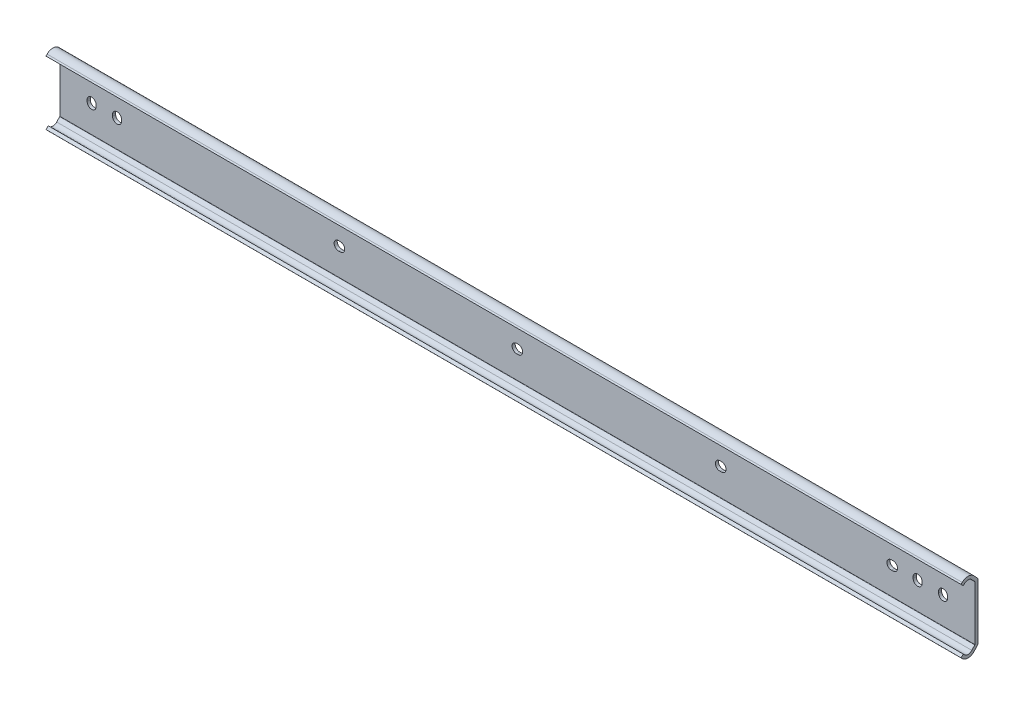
ISO-10303-21;
HEADER;
FILE_DESCRIPTION(('STEP AP214'),'2;1');
FILE_NAME('part.step','',(''),(''),'','','');
FILE_SCHEMA(('AUTOMOTIVE_DESIGN { 1 0 10303 214 1 1 1 1 }'));
ENDSEC;
DATA;
#1=APPLICATION_CONTEXT('core data for automotive mechanical design processes');
#2=APPLICATION_PROTOCOL_DEFINITION('international standard','automotive_design',2000,#1);
#3=PRODUCT_CONTEXT('',#1,'mechanical');
#4=PRODUCT('Part','Part','',(#3));
#5=PRODUCT_RELATED_PRODUCT_CATEGORY('part','',(#4));
#6=PRODUCT_DEFINITION_FORMATION('','',#4);
#7=PRODUCT_DEFINITION_CONTEXT('part definition',#1,'design');
#8=PRODUCT_DEFINITION('design','',#6,#7);
#9=PRODUCT_DEFINITION_SHAPE('','',#8);
#10=(LENGTH_UNIT() NAMED_UNIT(*) SI_UNIT(.MILLI.,.METRE.));
#11=(NAMED_UNIT(*) PLANE_ANGLE_UNIT() SI_UNIT($,.RADIAN.));
#12=(NAMED_UNIT(*) SI_UNIT($,.STERADIAN.) SOLID_ANGLE_UNIT());
#13=UNCERTAINTY_MEASURE_WITH_UNIT(LENGTH_MEASURE(1.E-05),#10,'distance_accuracy_value','');
#14=(GEOMETRIC_REPRESENTATION_CONTEXT(3) GLOBAL_UNCERTAINTY_ASSIGNED_CONTEXT((#13)) GLOBAL_UNIT_ASSIGNED_CONTEXT((#10,
#11,#12)) REPRESENTATION_CONTEXT('',''));
#15=CARTESIAN_POINT('',(0.,0.,0.));
#16=DIRECTION('',(0.,0.,1.));
#17=DIRECTION('',(1.,0.,0.));
#18=AXIS2_PLACEMENT_3D('',#15,#16,#17);
#19=CARTESIAN_POINT('',(-15.9,13.5610179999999,1.54999923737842));
#20=DIRECTION('',(0.,0.,-1.));
#21=DIRECTION('',(1.,0.,0.));
#22=AXIS2_PLACEMENT_3D('',#19,#20,#21);
#23=PLANE('',#22);
#24=DIRECTION('',(1.,0.,0.));
#25=VECTOR('',#24,1.);
#26=CARTESIAN_POINT('',(-15.9,13.5610179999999,1.54999923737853));
#27=LINE('',#26,#25);
#28=CARTESIAN_POINT('',(-15.9,13.5610179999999,1.54999923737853));
#29=VERTEX_POINT('',#28);
#30=CARTESIAN_POINT('',(441.3,13.5610179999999,1.54999923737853));
#31=VERTEX_POINT('',#30);
#32=EDGE_CURVE('E707',#29,#31,#27,.T.);
#33=ORIENTED_EDGE('',*,*,#32,.F.);
#34=DIRECTION('',(0.,1.,0.));
#35=VECTOR('',#34,1.);
#36=CARTESIAN_POINT('',(-15.9,13.5610179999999,1.54999923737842));
#37=LINE('',#36,#35);
#38=CARTESIAN_POINT('',(-15.9,-13.5610179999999,1.54999923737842));
#39=VERTEX_POINT('',#38);
#40=EDGE_CURVE('E655',#39,#29,#37,.T.);
#41=ORIENTED_EDGE('',*,*,#40,.F.);
#42=DIRECTION('',(1.,0.,0.));
#43=VECTOR('',#42,1.);
#44=CARTESIAN_POINT('',(-15.9,-13.5610179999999,1.54999923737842));
#45=LINE('',#44,#43);
#46=CARTESIAN_POINT('',(441.3,-13.5610179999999,1.54999923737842));
#47=VERTEX_POINT('',#46);
#48=EDGE_CURVE('E710',#39,#47,#45,.T.);
#49=ORIENTED_EDGE('',*,*,#48,.T.);
#50=DIRECTION('',(0.,1.,0.));
#51=VECTOR('',#50,1.);
#52=CARTESIAN_POINT('',(441.3,13.5610179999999,1.54999923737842));
#53=LINE('',#52,#51);
#54=EDGE_CURVE('E614',#47,#31,#53,.T.);
#55=ORIENTED_EDGE('',*,*,#54,.T.);
#56=EDGE_LOOP('',(#33,#41,#49,#55));
#57=FACE_BOUND('',#56,.T.);
#58=DIRECTION('',(0.,1.,0.));
#59=VECTOR('',#58,1.);
#60=CARTESIAN_POINT('',(427.65,-0.4,1.54999923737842));
#61=LINE('',#60,#59);
#62=CARTESIAN_POINT('',(427.65,-0.4,1.54999923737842));
#63=VERTEX_POINT('',#62);
#64=CARTESIAN_POINT('',(427.65,0.4,1.54999923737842));
#65=VERTEX_POINT('',#64);
#66=EDGE_CURVE('E362',#63,#65,#61,.T.);
#67=ORIENTED_EDGE('',*,*,#66,.F.);
#68=CARTESIAN_POINT('',(425.4,-0.4,1.54999923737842));
#69=DIRECTION('',(0.,0.,-1.));
#70=DIRECTION('',(1.,0.,0.));
#71=AXIS2_PLACEMENT_3D('',#68,#69,#70);
#72=CIRCLE('',#71,2.24999999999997);
#73=CARTESIAN_POINT('',(423.15,-0.4,1.54999923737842));
#74=VERTEX_POINT('',#73);
#75=EDGE_CURVE('E345',#74,#63,#72,.F.);
#76=ORIENTED_EDGE('',*,*,#75,.F.);
#77=DIRECTION('',(0.,-1.,0.));
#78=VECTOR('',#77,1.);
#79=CARTESIAN_POINT('',(423.15,-0.4,1.54999923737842));
#80=LINE('',#79,#78);
#81=CARTESIAN_POINT('',(423.15,0.4,1.54999923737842));
#82=VERTEX_POINT('',#81);
#83=EDGE_CURVE('E354',#82,#74,#80,.T.);
#84=ORIENTED_EDGE('',*,*,#83,.F.);
#85=CARTESIAN_POINT('',(425.4,0.4,1.54999923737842));
#86=DIRECTION('',(0.,0.,-1.));
#87=DIRECTION('',(1.,0.,0.));
#88=AXIS2_PLACEMENT_3D('',#85,#86,#87);
#89=CIRCLE('',#88,2.24999999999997);
#90=EDGE_CURVE('E29',#65,#82,#89,.F.);
#91=ORIENTED_EDGE('',*,*,#90,.F.);
#92=EDGE_LOOP('',(#67,#76,#84,#91));
#93=FACE_BOUND('',#92,.T.);
#94=DIRECTION('',(0.,1.,0.));
#95=VECTOR('',#94,1.);
#96=CARTESIAN_POINT('',(414.95,-0.4,1.54999923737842));
#97=LINE('',#96,#95);
#98=CARTESIAN_POINT('',(414.95,-0.4,1.54999923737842));
#99=VERTEX_POINT('',#98);
#100=CARTESIAN_POINT('',(414.95,0.4,1.54999923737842));
#101=VERTEX_POINT('',#100);
#102=EDGE_CURVE('E380',#99,#101,#97,.T.);
#103=ORIENTED_EDGE('',*,*,#102,.F.);
#104=CARTESIAN_POINT('',(412.7,-0.4,1.54999923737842));
#105=DIRECTION('',(0.,0.,-1.));
#106=DIRECTION('',(1.,0.,0.));
#107=AXIS2_PLACEMENT_3D('',#104,#105,#106);
#108=CIRCLE('',#107,2.24999999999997);
#109=CARTESIAN_POINT('',(410.45,-0.4,1.54999923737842));
#110=VERTEX_POINT('',#109);
#111=EDGE_CURVE('E383',#110,#99,#108,.F.);
#112=ORIENTED_EDGE('',*,*,#111,.F.);
#113=DIRECTION('',(0.,-1.,0.));
#114=VECTOR('',#113,1.);
#115=CARTESIAN_POINT('',(410.45,-0.4,1.54999923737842));
#116=LINE('',#115,#114);
#117=CARTESIAN_POINT('',(410.45,0.4,1.54999923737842));
#118=VERTEX_POINT('',#117);
#119=EDGE_CURVE('E400',#118,#110,#116,.T.);
#120=ORIENTED_EDGE('',*,*,#119,.F.);
#121=CARTESIAN_POINT('',(412.7,0.4,1.54999923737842));
#122=DIRECTION('',(0.,0.,-1.));
#123=DIRECTION('',(1.,0.,0.));
#124=AXIS2_PLACEMENT_3D('',#121,#122,#123);
#125=CIRCLE('',#124,2.24999999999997);
#126=EDGE_CURVE('E357',#101,#118,#125,.F.);
#127=ORIENTED_EDGE('',*,*,#126,.F.);
#128=EDGE_LOOP('',(#103,#112,#120,#127));
#129=FACE_BOUND('',#128,.T.);
#130=DIRECTION('',(1.,0.,0.));
#131=VECTOR('',#130,1.);
#132=CARTESIAN_POINT('',(399.6,-2.24999999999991,1.54999923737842));
#133=LINE('',#132,#131);
#134=CARTESIAN_POINT('',(399.6,-2.24999999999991,1.54999923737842));
#135=VERTEX_POINT('',#134);
#136=CARTESIAN_POINT('',(400.4,-2.24999999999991,1.54999923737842));
#137=VERTEX_POINT('',#136);
#138=EDGE_CURVE('E411',#135,#137,#133,.T.);
#139=ORIENTED_EDGE('',*,*,#138,.F.);
#140=CARTESIAN_POINT('',(399.6,0.,1.54999923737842));
#141=DIRECTION('',(0.,0.,-1.));
#142=DIRECTION('',(1.,0.,0.));
#143=AXIS2_PLACEMENT_3D('',#140,#141,#142);
#144=CIRCLE('',#143,2.24999999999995);
#145=CARTESIAN_POINT('',(399.6,2.25,1.54999923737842));
#146=VERTEX_POINT('',#145);
#147=EDGE_CURVE('E414',#146,#135,#144,.F.);
#148=ORIENTED_EDGE('',*,*,#147,.F.);
#149=DIRECTION('',(-1.,0.,0.));
#150=VECTOR('',#149,1.);
#151=CARTESIAN_POINT('',(399.6,2.25,1.54999923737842));
#152=LINE('',#151,#150);
#153=CARTESIAN_POINT('',(400.4,2.25,1.54999923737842));
#154=VERTEX_POINT('',#153);
#155=EDGE_CURVE('E431',#154,#146,#152,.T.);
#156=ORIENTED_EDGE('',*,*,#155,.F.);
#157=CARTESIAN_POINT('',(400.4,0.,1.54999923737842));
#158=DIRECTION('',(0.,0.,-1.));
#159=DIRECTION('',(1.,0.,0.));
#160=AXIS2_PLACEMENT_3D('',#157,#158,#159);
#161=CIRCLE('',#160,2.24999999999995);
#162=EDGE_CURVE('E409',#137,#154,#161,.F.);
#163=ORIENTED_EDGE('',*,*,#162,.F.);
#164=EDGE_LOOP('',(#139,#148,#156,#163));
#165=FACE_BOUND('',#164,.T.);
#166=DIRECTION('',(1.,0.,0.));
#167=VECTOR('',#166,1.);
#168=CARTESIAN_POINT('',(313.9,-2.24999999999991,1.54999923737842));
#169=LINE('',#168,#167);
#170=CARTESIAN_POINT('',(313.9,-2.24999999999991,1.54999923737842));
#171=VERTEX_POINT('',#170);
#172=CARTESIAN_POINT('',(314.7,-2.24999999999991,1.54999923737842));
#173=VERTEX_POINT('',#172);
#174=EDGE_CURVE('E442',#171,#173,#169,.T.);
#175=ORIENTED_EDGE('',*,*,#174,.F.);
#176=CARTESIAN_POINT('',(313.9,0.,1.54999923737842));
#177=DIRECTION('',(0.,0.,-1.));
#178=DIRECTION('',(1.,0.,0.));
#179=AXIS2_PLACEMENT_3D('',#176,#177,#178);
#180=CIRCLE('',#179,2.24999999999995);
#181=CARTESIAN_POINT('',(313.9,2.25,1.54999923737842));
#182=VERTEX_POINT('',#181);
#183=EDGE_CURVE('E445',#182,#171,#180,.F.);
#184=ORIENTED_EDGE('',*,*,#183,.F.);
#185=DIRECTION('',(-1.,0.,0.));
#186=VECTOR('',#185,1.);
#187=CARTESIAN_POINT('',(313.9,2.25,1.54999923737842));
#188=LINE('',#187,#186);
#189=CARTESIAN_POINT('',(314.7,2.25,1.54999923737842));
#190=VERTEX_POINT('',#189);
#191=EDGE_CURVE('E462',#190,#182,#188,.T.);
#192=ORIENTED_EDGE('',*,*,#191,.F.);
#193=CARTESIAN_POINT('',(314.7,0.,1.54999923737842));
#194=DIRECTION('',(0.,0.,-1.));
#195=DIRECTION('',(1.,0.,0.));
#196=AXIS2_PLACEMENT_3D('',#193,#194,#195);
#197=CIRCLE('',#196,2.24999999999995);
#198=EDGE_CURVE('E440',#173,#190,#197,.F.);
#199=ORIENTED_EDGE('',*,*,#198,.F.);
#200=EDGE_LOOP('',(#175,#184,#192,#199));
#201=FACE_BOUND('',#200,.T.);
#202=DIRECTION('',(1.,0.,0.));
#203=VECTOR('',#202,1.);
#204=CARTESIAN_POINT('',(212.3,-2.24999999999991,1.54999923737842));
#205=LINE('',#204,#203);
#206=CARTESIAN_POINT('',(212.3,-2.24999999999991,1.54999923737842));
#207=VERTEX_POINT('',#206);
#208=CARTESIAN_POINT('',(213.1,-2.24999999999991,1.54999923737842));
#209=VERTEX_POINT('',#208);
#210=EDGE_CURVE('E473',#207,#209,#205,.T.);
#211=ORIENTED_EDGE('',*,*,#210,.F.);
#212=CARTESIAN_POINT('',(212.3,0.,1.54999923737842));
#213=DIRECTION('',(0.,0.,-1.));
#214=DIRECTION('',(1.,0.,0.));
#215=AXIS2_PLACEMENT_3D('',#212,#213,#214);
#216=CIRCLE('',#215,2.24999999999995);
#217=CARTESIAN_POINT('',(212.3,2.25,1.54999923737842));
#218=VERTEX_POINT('',#217);
#219=EDGE_CURVE('E476',#218,#207,#216,.F.);
#220=ORIENTED_EDGE('',*,*,#219,.F.);
#221=DIRECTION('',(-1.,0.,0.));
#222=VECTOR('',#221,1.);
#223=CARTESIAN_POINT('',(212.3,2.25,1.54999923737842));
#224=LINE('',#223,#222);
#225=CARTESIAN_POINT('',(213.1,2.25,1.54999923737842));
#226=VERTEX_POINT('',#225);
#227=EDGE_CURVE('E493',#226,#218,#224,.T.);
#228=ORIENTED_EDGE('',*,*,#227,.F.);
#229=CARTESIAN_POINT('',(213.1,0.,1.54999923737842));
#230=DIRECTION('',(0.,0.,-1.));
#231=DIRECTION('',(1.,0.,0.));
#232=AXIS2_PLACEMENT_3D('',#229,#230,#231);
#233=CIRCLE('',#232,2.24999999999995);
#234=EDGE_CURVE('E471',#209,#226,#233,.F.);
#235=ORIENTED_EDGE('',*,*,#234,.F.);
#236=EDGE_LOOP('',(#211,#220,#228,#235));
#237=FACE_BOUND('',#236,.T.);
#238=DIRECTION('',(1.,0.,0.));
#239=VECTOR('',#238,1.);
#240=CARTESIAN_POINT('',(123.4,-2.24999999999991,1.54999923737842));
#241=LINE('',#240,#239);
#242=CARTESIAN_POINT('',(123.4,-2.24999999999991,1.54999923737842));
#243=VERTEX_POINT('',#242);
#244=CARTESIAN_POINT('',(124.2,-2.24999999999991,1.54999923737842));
#245=VERTEX_POINT('',#244);
#246=EDGE_CURVE('E504',#243,#245,#241,.T.);
#247=ORIENTED_EDGE('',*,*,#246,.F.);
#248=CARTESIAN_POINT('',(123.4,0.,1.54999923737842));
#249=DIRECTION('',(0.,0.,-1.));
#250=DIRECTION('',(1.,0.,0.));
#251=AXIS2_PLACEMENT_3D('',#248,#249,#250);
#252=CIRCLE('',#251,2.24999999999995);
#253=CARTESIAN_POINT('',(123.4,2.25,1.54999923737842));
#254=VERTEX_POINT('',#253);
#255=EDGE_CURVE('E507',#254,#243,#252,.F.);
#256=ORIENTED_EDGE('',*,*,#255,.F.);
#257=DIRECTION('',(-1.,0.,0.));
#258=VECTOR('',#257,1.);
#259=CARTESIAN_POINT('',(123.4,2.25,1.54999923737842));
#260=LINE('',#259,#258);
#261=CARTESIAN_POINT('',(124.2,2.25,1.54999923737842));
#262=VERTEX_POINT('',#261);
#263=EDGE_CURVE('E524',#262,#254,#260,.T.);
#264=ORIENTED_EDGE('',*,*,#263,.F.);
#265=CARTESIAN_POINT('',(124.2,0.,1.54999923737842));
#266=DIRECTION('',(0.,0.,-1.));
#267=DIRECTION('',(1.,0.,0.));
#268=AXIS2_PLACEMENT_3D('',#265,#266,#267);
#269=CIRCLE('',#268,2.24999999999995);
#270=EDGE_CURVE('E502',#245,#262,#269,.F.);
#271=ORIENTED_EDGE('',*,*,#270,.F.);
#272=EDGE_LOOP('',(#247,#256,#264,#271));
#273=FACE_BOUND('',#272,.T.);
#274=DIRECTION('',(0.,1.,0.));
#275=VECTOR('',#274,1.);
#276=CARTESIAN_POINT('',(14.95,-0.4,1.54999923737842));
#277=LINE('',#276,#275);
#278=CARTESIAN_POINT('',(14.95,-0.4,1.54999923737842));
#279=VERTEX_POINT('',#278);
#280=CARTESIAN_POINT('',(14.95,0.4,1.54999923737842));
#281=VERTEX_POINT('',#280);
#282=EDGE_CURVE('E535',#279,#281,#277,.T.);
#283=ORIENTED_EDGE('',*,*,#282,.F.);
#284=CARTESIAN_POINT('',(12.7,-0.4,1.54999923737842));
#285=DIRECTION('',(0.,0.,-1.));
#286=DIRECTION('',(1.,0.,0.));
#287=AXIS2_PLACEMENT_3D('',#284,#285,#286);
#288=CIRCLE('',#287,2.24999999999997);
#289=CARTESIAN_POINT('',(10.45,-0.4,1.54999923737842));
#290=VERTEX_POINT('',#289);
#291=EDGE_CURVE('E538',#290,#279,#288,.F.);
#292=ORIENTED_EDGE('',*,*,#291,.F.);
#293=DIRECTION('',(0.,-1.,0.));
#294=VECTOR('',#293,1.);
#295=CARTESIAN_POINT('',(10.45,-0.4,1.54999923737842));
#296=LINE('',#295,#294);
#297=CARTESIAN_POINT('',(10.45,0.4,1.54999923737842));
#298=VERTEX_POINT('',#297);
#299=EDGE_CURVE('E555',#298,#290,#296,.T.);
#300=ORIENTED_EDGE('',*,*,#299,.F.);
#301=CARTESIAN_POINT('',(12.7,0.4,1.54999923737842));
#302=DIRECTION('',(0.,0.,-1.));
#303=DIRECTION('',(1.,0.,0.));
#304=AXIS2_PLACEMENT_3D('',#301,#302,#303);
#305=CIRCLE('',#304,2.24999999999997);
#306=EDGE_CURVE('E533',#281,#298,#305,.F.);
#307=ORIENTED_EDGE('',*,*,#306,.F.);
#308=EDGE_LOOP('',(#283,#292,#300,#307));
#309=FACE_BOUND('',#308,.T.);
#310=DIRECTION('',(0.,1.,0.));
#311=VECTOR('',#310,1.);
#312=CARTESIAN_POINT('',(2.25000000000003,-0.4,1.54999923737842));
#313=LINE('',#312,#311);
#314=CARTESIAN_POINT('',(2.25000000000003,-0.4,1.54999923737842));
#315=VERTEX_POINT('',#314);
#316=CARTESIAN_POINT('',(2.25000000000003,0.4,1.54999923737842));
#317=VERTEX_POINT('',#316);
#318=EDGE_CURVE('E566',#315,#317,#313,.T.);
#319=ORIENTED_EDGE('',*,*,#318,.F.);
#320=CARTESIAN_POINT('',(0.,-0.4,1.54999923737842));
#321=DIRECTION('',(0.,0.,-1.));
#322=DIRECTION('',(1.,0.,0.));
#323=AXIS2_PLACEMENT_3D('',#320,#321,#322);
#324=CIRCLE('',#323,2.24999999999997);
#325=CARTESIAN_POINT('',(-2.24999999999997,-0.4,1.54999923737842));
#326=VERTEX_POINT('',#325);
#327=EDGE_CURVE('E569',#326,#315,#324,.F.);
#328=ORIENTED_EDGE('',*,*,#327,.F.);
#329=DIRECTION('',(0.,-1.,0.));
#330=VECTOR('',#329,1.);
#331=CARTESIAN_POINT('',(-2.24999999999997,-0.4,1.54999923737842));
#332=LINE('',#331,#330);
#333=CARTESIAN_POINT('',(-2.24999999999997,0.4,1.54999923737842));
#334=VERTEX_POINT('',#333);
#335=EDGE_CURVE('E586',#334,#326,#332,.T.);
#336=ORIENTED_EDGE('',*,*,#335,.F.);
#337=CARTESIAN_POINT('',(0.,0.4,1.54999923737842));
#338=DIRECTION('',(0.,0.,-1.));
#339=DIRECTION('',(1.,0.,0.));
#340=AXIS2_PLACEMENT_3D('',#337,#338,#339);
#341=CIRCLE('',#340,2.24999999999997);
#342=EDGE_CURVE('E564',#317,#334,#341,.F.);
#343=ORIENTED_EDGE('',*,*,#342,.F.);
#344=EDGE_LOOP('',(#319,#328,#336,#343));
#345=FACE_BOUND('',#344,.T.);
#346=ADVANCED_FACE('F14',(#57,#93,#129,#165,#201,#237,#273,#309,#345),#23,.F.);
#347=CARTESIAN_POINT('',(-15.9,13.5610176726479,0.));
#348=DIRECTION('',(0.,0.,1.));
#349=DIRECTION('',(-1.,0.,0.));
#350=AXIS2_PLACEMENT_3D('',#347,#348,#349);
#351=PLANE('',#350);
#352=DIRECTION('',(0.,1.,0.));
#353=VECTOR('',#352,1.);
#354=CARTESIAN_POINT('',(423.15,-0.4,0.));
#355=LINE('',#354,#353);
#356=CARTESIAN_POINT('',(423.15,-0.4,0.));
#357=VERTEX_POINT('',#356);
#358=CARTESIAN_POINT('',(423.15,0.4,0.));
#359=VERTEX_POINT('',#358);
#360=EDGE_CURVE('E364',#357,#359,#355,.T.);
#361=ORIENTED_EDGE('',*,*,#360,.F.);
#362=CARTESIAN_POINT('',(425.4,-0.4,0.));
#363=DIRECTION('',(0.,0.,-1.));
#364=DIRECTION('',(1.,0.,0.));
#365=AXIS2_PLACEMENT_3D('',#362,#363,#364);
#366=CIRCLE('',#365,2.24999999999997);
#367=CARTESIAN_POINT('',(427.65,-0.4,0.));
#368=VERTEX_POINT('',#367);
#369=EDGE_CURVE('E37',#368,#357,#366,.T.);
#370=ORIENTED_EDGE('',*,*,#369,.F.);
#371=DIRECTION('',(0.,-1.,0.));
#372=VECTOR('',#371,1.);
#373=CARTESIAN_POINT('',(427.65,-0.4,0.));
#374=LINE('',#373,#372);
#375=CARTESIAN_POINT('',(427.65,0.4,0.));
#376=VERTEX_POINT('',#375);
#377=EDGE_CURVE('E351',#376,#368,#374,.T.);
#378=ORIENTED_EDGE('',*,*,#377,.F.);
#379=CARTESIAN_POINT('',(425.4,0.4,0.));
#380=DIRECTION('',(0.,0.,-1.));
#381=DIRECTION('',(1.,0.,0.));
#382=AXIS2_PLACEMENT_3D('',#379,#380,#381);
#383=CIRCLE('',#382,2.24999999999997);
#384=EDGE_CURVE('E370',#359,#376,#383,.T.);
#385=ORIENTED_EDGE('',*,*,#384,.F.);
#386=EDGE_LOOP('',(#361,#370,#378,#385));
#387=FACE_BOUND('',#386,.T.);
#388=DIRECTION('',(0.,1.,0.));
#389=VECTOR('',#388,1.);
#390=CARTESIAN_POINT('',(410.45,-0.4,0.));
#391=LINE('',#390,#389);
#392=CARTESIAN_POINT('',(410.45,-0.4,0.));
#393=VERTEX_POINT('',#392);
#394=CARTESIAN_POINT('',(410.45,0.4,0.));
#395=VERTEX_POINT('',#394);
#396=EDGE_CURVE('E388',#393,#395,#391,.T.);
#397=ORIENTED_EDGE('',*,*,#396,.F.);
#398=CARTESIAN_POINT('',(412.7,-0.4,0.));
#399=DIRECTION('',(0.,0.,-1.));
#400=DIRECTION('',(1.,0.,0.));
#401=AXIS2_PLACEMENT_3D('',#398,#399,#400);
#402=CIRCLE('',#401,2.24999999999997);
#403=CARTESIAN_POINT('',(414.95,-0.4,0.));
#404=VERTEX_POINT('',#403);
#405=EDGE_CURVE('E386',#404,#393,#402,.T.);
#406=ORIENTED_EDGE('',*,*,#405,.F.);
#407=DIRECTION('',(0.,-1.,0.));
#408=VECTOR('',#407,1.);
#409=CARTESIAN_POINT('',(414.95,-0.4,0.));
#410=LINE('',#409,#408);
#411=CARTESIAN_POINT('',(414.95,0.4,0.));
#412=VERTEX_POINT('',#411);
#413=EDGE_CURVE('E394',#412,#404,#410,.T.);
#414=ORIENTED_EDGE('',*,*,#413,.F.);
#415=CARTESIAN_POINT('',(412.7,0.4,0.));
#416=DIRECTION('',(0.,0.,-1.));
#417=DIRECTION('',(1.,0.,0.));
#418=AXIS2_PLACEMENT_3D('',#415,#416,#417);
#419=CIRCLE('',#418,2.24999999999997);
#420=EDGE_CURVE('E391',#395,#412,#419,.T.);
#421=ORIENTED_EDGE('',*,*,#420,.F.);
#422=EDGE_LOOP('',(#397,#406,#414,#421));
#423=FACE_BOUND('',#422,.T.);
#424=DIRECTION('',(1.,0.,0.));
#425=VECTOR('',#424,1.);
#426=CARTESIAN_POINT('',(399.6,2.25,0.));
#427=LINE('',#426,#425);
#428=CARTESIAN_POINT('',(399.6,2.25,0.));
#429=VERTEX_POINT('',#428);
#430=CARTESIAN_POINT('',(400.4,2.25,0.));
#431=VERTEX_POINT('',#430);
#432=EDGE_CURVE('E419',#429,#431,#427,.T.);
#433=ORIENTED_EDGE('',*,*,#432,.F.);
#434=CARTESIAN_POINT('',(399.6,0.,0.));
#435=DIRECTION('',(0.,0.,-1.));
#436=DIRECTION('',(1.,0.,0.));
#437=AXIS2_PLACEMENT_3D('',#434,#435,#436);
#438=CIRCLE('',#437,2.24999999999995);
#439=CARTESIAN_POINT('',(399.6,-2.24999999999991,0.));
#440=VERTEX_POINT('',#439);
#441=EDGE_CURVE('E417',#440,#429,#438,.T.);
#442=ORIENTED_EDGE('',*,*,#441,.F.);
#443=DIRECTION('',(-1.,0.,0.));
#444=VECTOR('',#443,1.);
#445=CARTESIAN_POINT('',(399.6,-2.24999999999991,0.));
#446=LINE('',#445,#444);
#447=CARTESIAN_POINT('',(400.4,-2.24999999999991,0.));
#448=VERTEX_POINT('',#447);
#449=EDGE_CURVE('E425',#448,#440,#446,.T.);
#450=ORIENTED_EDGE('',*,*,#449,.F.);
#451=CARTESIAN_POINT('',(400.4,0.,0.));
#452=DIRECTION('',(0.,0.,-1.));
#453=DIRECTION('',(1.,0.,0.));
#454=AXIS2_PLACEMENT_3D('',#451,#452,#453);
#455=CIRCLE('',#454,2.24999999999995);
#456=EDGE_CURVE('E422',#431,#448,#455,.T.);
#457=ORIENTED_EDGE('',*,*,#456,.F.);
#458=EDGE_LOOP('',(#433,#442,#450,#457));
#459=FACE_BOUND('',#458,.T.);
#460=DIRECTION('',(1.,0.,0.));
#461=VECTOR('',#460,1.);
#462=CARTESIAN_POINT('',(313.9,2.25,0.));
#463=LINE('',#462,#461);
#464=CARTESIAN_POINT('',(313.9,2.25,0.));
#465=VERTEX_POINT('',#464);
#466=CARTESIAN_POINT('',(314.7,2.25,0.));
#467=VERTEX_POINT('',#466);
#468=EDGE_CURVE('E450',#465,#467,#463,.T.);
#469=ORIENTED_EDGE('',*,*,#468,.F.);
#470=CARTESIAN_POINT('',(313.9,0.,0.));
#471=DIRECTION('',(0.,0.,-1.));
#472=DIRECTION('',(1.,0.,0.));
#473=AXIS2_PLACEMENT_3D('',#470,#471,#472);
#474=CIRCLE('',#473,2.24999999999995);
#475=CARTESIAN_POINT('',(313.9,-2.24999999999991,0.));
#476=VERTEX_POINT('',#475);
#477=EDGE_CURVE('E448',#476,#465,#474,.T.);
#478=ORIENTED_EDGE('',*,*,#477,.F.);
#479=DIRECTION('',(-1.,0.,0.));
#480=VECTOR('',#479,1.);
#481=CARTESIAN_POINT('',(313.9,-2.24999999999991,0.));
#482=LINE('',#481,#480);
#483=CARTESIAN_POINT('',(314.7,-2.24999999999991,0.));
#484=VERTEX_POINT('',#483);
#485=EDGE_CURVE('E456',#484,#476,#482,.T.);
#486=ORIENTED_EDGE('',*,*,#485,.F.);
#487=CARTESIAN_POINT('',(314.7,0.,0.));
#488=DIRECTION('',(0.,0.,-1.));
#489=DIRECTION('',(1.,0.,0.));
#490=AXIS2_PLACEMENT_3D('',#487,#488,#489);
#491=CIRCLE('',#490,2.24999999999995);
#492=EDGE_CURVE('E453',#467,#484,#491,.T.);
#493=ORIENTED_EDGE('',*,*,#492,.F.);
#494=EDGE_LOOP('',(#469,#478,#486,#493));
#495=FACE_BOUND('',#494,.T.);
#496=DIRECTION('',(1.,0.,0.));
#497=VECTOR('',#496,1.);
#498=CARTESIAN_POINT('',(212.3,2.25,0.));
#499=LINE('',#498,#497);
#500=CARTESIAN_POINT('',(212.3,2.25,0.));
#501=VERTEX_POINT('',#500);
#502=CARTESIAN_POINT('',(213.1,2.25,0.));
#503=VERTEX_POINT('',#502);
#504=EDGE_CURVE('E481',#501,#503,#499,.T.);
#505=ORIENTED_EDGE('',*,*,#504,.F.);
#506=CARTESIAN_POINT('',(212.3,0.,0.));
#507=DIRECTION('',(0.,0.,-1.));
#508=DIRECTION('',(1.,0.,0.));
#509=AXIS2_PLACEMENT_3D('',#506,#507,#508);
#510=CIRCLE('',#509,2.24999999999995);
#511=CARTESIAN_POINT('',(212.3,-2.24999999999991,0.));
#512=VERTEX_POINT('',#511);
#513=EDGE_CURVE('E479',#512,#501,#510,.T.);
#514=ORIENTED_EDGE('',*,*,#513,.F.);
#515=DIRECTION('',(-1.,0.,0.));
#516=VECTOR('',#515,1.);
#517=CARTESIAN_POINT('',(212.3,-2.24999999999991,0.));
#518=LINE('',#517,#516);
#519=CARTESIAN_POINT('',(213.1,-2.24999999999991,0.));
#520=VERTEX_POINT('',#519);
#521=EDGE_CURVE('E487',#520,#512,#518,.T.);
#522=ORIENTED_EDGE('',*,*,#521,.F.);
#523=CARTESIAN_POINT('',(213.1,0.,0.));
#524=DIRECTION('',(0.,0.,-1.));
#525=DIRECTION('',(1.,0.,0.));
#526=AXIS2_PLACEMENT_3D('',#523,#524,#525);
#527=CIRCLE('',#526,2.24999999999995);
#528=EDGE_CURVE('E484',#503,#520,#527,.T.);
#529=ORIENTED_EDGE('',*,*,#528,.F.);
#530=EDGE_LOOP('',(#505,#514,#522,#529));
#531=FACE_BOUND('',#530,.T.);
#532=DIRECTION('',(1.,0.,0.));
#533=VECTOR('',#532,1.);
#534=CARTESIAN_POINT('',(123.4,2.25,0.));
#535=LINE('',#534,#533);
#536=CARTESIAN_POINT('',(123.4,2.25,0.));
#537=VERTEX_POINT('',#536);
#538=CARTESIAN_POINT('',(124.2,2.25,0.));
#539=VERTEX_POINT('',#538);
#540=EDGE_CURVE('E512',#537,#539,#535,.T.);
#541=ORIENTED_EDGE('',*,*,#540,.F.);
#542=CARTESIAN_POINT('',(123.4,0.,0.));
#543=DIRECTION('',(0.,0.,-1.));
#544=DIRECTION('',(1.,0.,0.));
#545=AXIS2_PLACEMENT_3D('',#542,#543,#544);
#546=CIRCLE('',#545,2.24999999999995);
#547=CARTESIAN_POINT('',(123.4,-2.24999999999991,0.));
#548=VERTEX_POINT('',#547);
#549=EDGE_CURVE('E510',#548,#537,#546,.T.);
#550=ORIENTED_EDGE('',*,*,#549,.F.);
#551=DIRECTION('',(-1.,0.,0.));
#552=VECTOR('',#551,1.);
#553=CARTESIAN_POINT('',(123.4,-2.24999999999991,0.));
#554=LINE('',#553,#552);
#555=CARTESIAN_POINT('',(124.2,-2.24999999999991,0.));
#556=VERTEX_POINT('',#555);
#557=EDGE_CURVE('E518',#556,#548,#554,.T.);
#558=ORIENTED_EDGE('',*,*,#557,.F.);
#559=CARTESIAN_POINT('',(124.2,0.,0.));
#560=DIRECTION('',(0.,0.,-1.));
#561=DIRECTION('',(1.,0.,0.));
#562=AXIS2_PLACEMENT_3D('',#559,#560,#561);
#563=CIRCLE('',#562,2.24999999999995);
#564=EDGE_CURVE('E515',#539,#556,#563,.T.);
#565=ORIENTED_EDGE('',*,*,#564,.F.);
#566=EDGE_LOOP('',(#541,#550,#558,#565));
#567=FACE_BOUND('',#566,.T.);
#568=DIRECTION('',(0.,1.,0.));
#569=VECTOR('',#568,1.);
#570=CARTESIAN_POINT('',(10.45,-0.4,0.));
#571=LINE('',#570,#569);
#572=CARTESIAN_POINT('',(10.45,-0.4,0.));
#573=VERTEX_POINT('',#572);
#574=CARTESIAN_POINT('',(10.45,0.4,0.));
#575=VERTEX_POINT('',#574);
#576=EDGE_CURVE('E543',#573,#575,#571,.T.);
#577=ORIENTED_EDGE('',*,*,#576,.F.);
#578=CARTESIAN_POINT('',(12.7,-0.4,0.));
#579=DIRECTION('',(0.,0.,-1.));
#580=DIRECTION('',(1.,0.,0.));
#581=AXIS2_PLACEMENT_3D('',#578,#579,#580);
#582=CIRCLE('',#581,2.24999999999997);
#583=CARTESIAN_POINT('',(14.95,-0.4,0.));
#584=VERTEX_POINT('',#583);
#585=EDGE_CURVE('E541',#584,#573,#582,.T.);
#586=ORIENTED_EDGE('',*,*,#585,.F.);
#587=DIRECTION('',(0.,-1.,0.));
#588=VECTOR('',#587,1.);
#589=CARTESIAN_POINT('',(14.95,-0.4,0.));
#590=LINE('',#589,#588);
#591=CARTESIAN_POINT('',(14.95,0.4,0.));
#592=VERTEX_POINT('',#591);
#593=EDGE_CURVE('E549',#592,#584,#590,.T.);
#594=ORIENTED_EDGE('',*,*,#593,.F.);
#595=CARTESIAN_POINT('',(12.7,0.4,0.));
#596=DIRECTION('',(0.,0.,-1.));
#597=DIRECTION('',(1.,0.,0.));
#598=AXIS2_PLACEMENT_3D('',#595,#596,#597);
#599=CIRCLE('',#598,2.24999999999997);
#600=EDGE_CURVE('E546',#575,#592,#599,.T.);
#601=ORIENTED_EDGE('',*,*,#600,.F.);
#602=EDGE_LOOP('',(#577,#586,#594,#601));
#603=FACE_BOUND('',#602,.T.);
#604=DIRECTION('',(0.,1.,0.));
#605=VECTOR('',#604,1.);
#606=CARTESIAN_POINT('',(-2.24999999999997,-0.4,0.));
#607=LINE('',#606,#605);
#608=CARTESIAN_POINT('',(-2.24999999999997,-0.4,0.));
#609=VERTEX_POINT('',#608);
#610=CARTESIAN_POINT('',(-2.24999999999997,0.4,0.));
#611=VERTEX_POINT('',#610);
#612=EDGE_CURVE('E574',#609,#611,#607,.T.);
#613=ORIENTED_EDGE('',*,*,#612,.F.);
#614=CARTESIAN_POINT('',(0.,-0.4,0.));
#615=DIRECTION('',(0.,0.,-1.));
#616=DIRECTION('',(1.,0.,0.));
#617=AXIS2_PLACEMENT_3D('',#614,#615,#616);
#618=CIRCLE('',#617,2.24999999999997);
#619=CARTESIAN_POINT('',(2.25000000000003,-0.4,0.));
#620=VERTEX_POINT('',#619);
#621=EDGE_CURVE('E572',#620,#609,#618,.T.);
#622=ORIENTED_EDGE('',*,*,#621,.F.);
#623=DIRECTION('',(0.,-1.,0.));
#624=VECTOR('',#623,1.);
#625=CARTESIAN_POINT('',(2.25000000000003,-0.4,0.));
#626=LINE('',#625,#624);
#627=CARTESIAN_POINT('',(2.25000000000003,0.4,0.));
#628=VERTEX_POINT('',#627);
#629=EDGE_CURVE('E580',#628,#620,#626,.T.);
#630=ORIENTED_EDGE('',*,*,#629,.F.);
#631=CARTESIAN_POINT('',(0.,0.4,0.));
#632=DIRECTION('',(0.,0.,-1.));
#633=DIRECTION('',(1.,0.,0.));
#634=AXIS2_PLACEMENT_3D('',#631,#632,#633);
#635=CIRCLE('',#634,2.24999999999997);
#636=EDGE_CURVE('E577',#611,#628,#635,.T.);
#637=ORIENTED_EDGE('',*,*,#636,.F.);
#638=EDGE_LOOP('',(#613,#622,#630,#637));
#639=FACE_BOUND('',#638,.T.);
#640=DIRECTION('',(1.,0.,0.));
#641=VECTOR('',#640,1.);
#642=CARTESIAN_POINT('',(-15.9,-13.5610176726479,0.));
#643=LINE('',#642,#641);
#644=CARTESIAN_POINT('',(-15.9,-13.5610176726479,0.));
#645=VERTEX_POINT('',#644);
#646=CARTESIAN_POINT('',(441.3,-13.5610176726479,0.));
#647=VERTEX_POINT('',#646);
#648=EDGE_CURVE('E677',#645,#647,#643,.T.);
#649=ORIENTED_EDGE('',*,*,#648,.F.);
#650=DIRECTION('',(0.,-1.,0.));
#651=VECTOR('',#650,1.);
#652=CARTESIAN_POINT('',(-15.9,13.5610176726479,0.));
#653=LINE('',#652,#651);
#654=CARTESIAN_POINT('',(-15.9,13.5610176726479,0.));
#655=VERTEX_POINT('',#654);
#656=EDGE_CURVE('E675',#655,#645,#653,.T.);
#657=ORIENTED_EDGE('',*,*,#656,.F.);
#658=DIRECTION('',(1.,0.,0.));
#659=VECTOR('',#658,1.);
#660=CARTESIAN_POINT('',(-15.9,13.5610176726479,0.));
#661=LINE('',#660,#659);
#662=CARTESIAN_POINT('',(441.3,13.5610176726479,0.));
#663=VERTEX_POINT('',#662);
#664=EDGE_CURVE('E680',#655,#663,#661,.T.);
#665=ORIENTED_EDGE('',*,*,#664,.T.);
#666=DIRECTION('',(0.,-1.,0.));
#667=VECTOR('',#666,1.);
#668=CARTESIAN_POINT('',(441.3,13.5610176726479,0.));
#669=LINE('',#668,#667);
#670=EDGE_CURVE('E634',#663,#647,#669,.T.);
#671=ORIENTED_EDGE('',*,*,#670,.T.);
#672=EDGE_LOOP('',(#649,#657,#665,#671));
#673=FACE_BOUND('',#672,.T.);
#674=ADVANCED_FACE('F765',(#387,#423,#459,#495,#531,#567,#603,#639,#673),#351,.F.);
#675=CARTESIAN_POINT('',(-15.9,-13.5610175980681,1.80000204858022));
#676=DIRECTION('',(1.,0.,0.));
#677=DIRECTION('',(0.,0.,1.));
#678=AXIS2_PLACEMENT_3D('',#675,#676,#677);
#679=PLANE('',#678);
#680=ORIENTED_EDGE('',*,*,#40,.T.);
#681=CARTESIAN_POINT('',(-15.9,13.5610175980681,1.80000204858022));
#682=DIRECTION('',(1.,0.,0.));
#683=DIRECTION('',(0.,0.,1.));
#684=AXIS2_PLACEMENT_3D('',#681,#682,#683);
#685=CIRCLE('',#684,0.250002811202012);
#686=CARTESIAN_POINT('',(-15.9,13.7341215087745,1.61962344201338));
#687=VERTEX_POINT('',#686);
#688=EDGE_CURVE('E657',#29,#687,#685,.T.);
#689=ORIENTED_EDGE('',*,*,#688,.T.);
#690=DIRECTION('',(0.,0.72150413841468,0.692410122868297));
#691=VECTOR('',#690,1.);
#692=CARTESIAN_POINT('',(-15.9,13.7341215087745,1.61962344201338));
#693=LINE('',#692,#691);
#694=CARTESIAN_POINT('',(-15.9,15.2920521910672,3.11473194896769));
#695=VERTEX_POINT('',#694);
#696=EDGE_CURVE('E659',#687,#695,#693,.T.);
#697=ORIENTED_EDGE('',*,*,#696,.T.);
#698=CARTESIAN_POINT('',(-15.9,13.5750002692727,4.99999970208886));
#699=DIRECTION('',(1.,0.,0.));
#700=DIRECTION('',(0.,0.,1.));
#701=AXIS2_PLACEMENT_3D('',#698,#699,#700);
#702=CIRCLE('',#701,2.55000035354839);
#703=CARTESIAN_POINT('',(-15.9,15.2920597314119,6.88526058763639));
#704=VERTEX_POINT('',#703);
#705=EDGE_CURVE('E661',#695,#704,#702,.T.);
#706=ORIENTED_EDGE('',*,*,#705,.T.);
#707=DIRECTION('',(0.,-0.721504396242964,0.692409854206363));
#708=VECTOR('',#707,1.);
#709=CARTESIAN_POINT('',(-15.9,15.2920597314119,6.88526058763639));
#710=LINE('',#709,#708);
#711=CARTESIAN_POINT('',(-15.9,14.7934625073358,7.36375196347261));
#712=VERTEX_POINT('',#711);
#713=EDGE_CURVE('E663',#704,#712,#710,.T.);
#714=ORIENTED_EDGE('',*,*,#713,.T.);
#715=DIRECTION('',(0.,0.707106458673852,0.707107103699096));
#716=VECTOR('',#715,1.);
#717=CARTESIAN_POINT('',(-15.9,14.7934625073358,7.36375196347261));
#718=LINE('',#717,#716);
#719=CARTESIAN_POINT('',(-15.9,15.8897095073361,8.45999996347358));
#720=VERTEX_POINT('',#719);
#721=EDGE_CURVE('E665',#712,#720,#718,.T.);
#722=ORIENTED_EDGE('',*,*,#721,.T.);
#723=DIRECTION('',(0.,0.721503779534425,-0.692410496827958));
#724=VECTOR('',#723,1.);
#725=CARTESIAN_POINT('',(-15.9,16.4741385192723,7.89913695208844));
#726=LINE('',#725,#724);
#727=CARTESIAN_POINT('',(-15.9,16.4741385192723,7.89913695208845));
#728=VERTEX_POINT('',#727);
#729=EDGE_CURVE('E667',#720,#728,#726,.T.);
#730=ORIENTED_EDGE('',*,*,#729,.T.);
#731=CARTESIAN_POINT('',(-15.9,13.5750002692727,4.99999970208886));
#732=DIRECTION('',(-1.,0.,0.));
#733=DIRECTION('',(0.,0.,-1.));
#734=AXIS2_PLACEMENT_3D('',#731,#732,#733);
#735=CIRCLE('',#734,4.09999992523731);
#736=CARTESIAN_POINT('',(-15.9,16.4741380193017,2.10086195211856));
#737=VERTEX_POINT('',#736);
#738=EDGE_CURVE('E669',#728,#737,#735,.T.);
#739=ORIENTED_EDGE('',*,*,#738,.T.);
#740=DIRECTION('',(0.,-0.721504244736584,-0.692410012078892));
#741=VECTOR('',#740,1.);
#742=CARTESIAN_POINT('',(-15.9,14.8073560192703,0.501291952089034));
#743=LINE('',#742,#741);
#744=CARTESIAN_POINT('',(-15.9,14.8073560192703,0.501291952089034));
#745=VERTEX_POINT('',#744);
#746=EDGE_CURVE('E671',#737,#745,#743,.T.);
#747=ORIENTED_EDGE('',*,*,#746,.T.);
#748=CARTESIAN_POINT('',(-15.9,13.5610175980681,1.80000204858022));
#749=DIRECTION('',(-1.,0.,0.));
#750=DIRECTION('',(0.,0.,-1.));
#751=AXIS2_PLACEMENT_3D('',#748,#749,#750);
#752=CIRCLE('',#751,1.80000204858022);
#753=EDGE_CURVE('E673',#745,#655,#752,.T.);
#754=ORIENTED_EDGE('',*,*,#753,.T.);
#755=ORIENTED_EDGE('',*,*,#656,.T.);
#756=CARTESIAN_POINT('',(-15.9,-13.5610175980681,1.80000204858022));
#757=DIRECTION('',(-1.,0.,0.));
#758=DIRECTION('',(0.,0.,1.));
#759=AXIS2_PLACEMENT_3D('',#756,#757,#758);
#760=CIRCLE('',#759,1.80000204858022);
#761=CARTESIAN_POINT('',(-15.9,-14.8073560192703,0.501291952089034));
#762=VERTEX_POINT('',#761);
#763=EDGE_CURVE('E636',#645,#762,#760,.T.);
#764=ORIENTED_EDGE('',*,*,#763,.T.);
#765=DIRECTION('',(0.,-0.721504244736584,0.692410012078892));
#766=VECTOR('',#765,1.);
#767=CARTESIAN_POINT('',(-15.9,-14.8073560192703,0.501291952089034));
#768=LINE('',#767,#766);
#769=CARTESIAN_POINT('',(-15.9,-16.4741380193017,2.10086195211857));
#770=VERTEX_POINT('',#769);
#771=EDGE_CURVE('E639',#762,#770,#768,.T.);
#772=ORIENTED_EDGE('',*,*,#771,.T.);
#773=CARTESIAN_POINT('',(-15.9,-13.5750002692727,4.99999970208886));
#774=DIRECTION('',(-1.,0.,0.));
#775=DIRECTION('',(0.,0.,1.));
#776=AXIS2_PLACEMENT_3D('',#773,#774,#775);
#777=CIRCLE('',#776,4.09999992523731);
#778=CARTESIAN_POINT('',(-15.9,-16.4741385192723,7.89913695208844));
#779=VERTEX_POINT('',#778);
#780=EDGE_CURVE('E641',#770,#779,#777,.T.);
#781=ORIENTED_EDGE('',*,*,#780,.T.);
#782=DIRECTION('',(0.,0.721503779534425,0.692410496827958));
#783=VECTOR('',#782,1.);
#784=CARTESIAN_POINT('',(-15.9,-16.4741385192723,7.89913695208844));
#785=LINE('',#784,#783);
#786=CARTESIAN_POINT('',(-15.9,-15.8897095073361,8.45999996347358));
#787=VERTEX_POINT('',#786);
#788=EDGE_CURVE('E643',#779,#787,#785,.T.);
#789=ORIENTED_EDGE('',*,*,#788,.T.);
#790=DIRECTION('',(0.,0.707106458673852,-0.707107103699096));
#791=VECTOR('',#790,1.);
#792=CARTESIAN_POINT('',(-15.9,-14.7934625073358,7.36375196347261));
#793=LINE('',#792,#791);
#794=CARTESIAN_POINT('',(-15.9,-14.7934625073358,7.36375196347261));
#795=VERTEX_POINT('',#794);
#796=EDGE_CURVE('E645',#787,#795,#793,.T.);
#797=ORIENTED_EDGE('',*,*,#796,.T.);
#798=DIRECTION('',(0.,-0.721504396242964,-0.692409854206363));
#799=VECTOR('',#798,1.);
#800=CARTESIAN_POINT('',(-15.9,-15.2920597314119,6.88526058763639));
#801=LINE('',#800,#799);
#802=CARTESIAN_POINT('',(-15.9,-15.2920597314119,6.88526058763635));
#803=VERTEX_POINT('',#802);
#804=EDGE_CURVE('E647',#795,#803,#801,.T.);
#805=ORIENTED_EDGE('',*,*,#804,.T.);
#806=CARTESIAN_POINT('',(-15.9,-13.5750002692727,4.99999970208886));
#807=DIRECTION('',(1.,0.,0.));
#808=DIRECTION('',(0.,0.,-1.));
#809=AXIS2_PLACEMENT_3D('',#806,#807,#808);
#810=CIRCLE('',#809,2.55000035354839);
#811=CARTESIAN_POINT('',(-15.9,-15.2920521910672,3.11473194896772));
#812=VERTEX_POINT('',#811);
#813=EDGE_CURVE('E649',#803,#812,#810,.T.);
#814=ORIENTED_EDGE('',*,*,#813,.T.);
#815=DIRECTION('',(0.,0.72150413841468,-0.692410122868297));
#816=VECTOR('',#815,1.);
#817=CARTESIAN_POINT('',(-15.9,-13.7341215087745,1.61962344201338));
#818=LINE('',#817,#816);
#819=CARTESIAN_POINT('',(-15.9,-13.7341215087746,1.6196234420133));
#820=VERTEX_POINT('',#819);
#821=EDGE_CURVE('E651',#812,#820,#818,.T.);
#822=ORIENTED_EDGE('',*,*,#821,.T.);
#823=CARTESIAN_POINT('',(-15.9,-13.5610175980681,1.80000204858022));
#824=DIRECTION('',(1.,0.,0.));
#825=DIRECTION('',(0.,0.,-1.));
#826=AXIS2_PLACEMENT_3D('',#823,#824,#825);
#827=CIRCLE('',#826,0.250002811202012);
#828=EDGE_CURVE('E653',#820,#39,#827,.T.);
#829=ORIENTED_EDGE('',*,*,#828,.T.);
#830=EDGE_LOOP('',(#680,#689,#697,#706,#714,#722,#730,#739,#747,#754,#755,#764,#772,#781,#789,
#797,#805,#814,#822,#829));
#831=FACE_BOUND('',#830,.T.);
#832=ADVANCED_FACE('F754',(#831),#679,.F.);
#833=CARTESIAN_POINT('',(441.3,-13.5610175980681,1.80000204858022));
#834=DIRECTION('',(1.,0.,0.));
#835=DIRECTION('',(0.,0.,1.));
#836=AXIS2_PLACEMENT_3D('',#833,#834,#835);
#837=PLANE('',#836);
#838=CARTESIAN_POINT('',(441.3,-13.5610175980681,1.80000204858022));
#839=DIRECTION('',(-1.,0.,0.));
#840=DIRECTION('',(0.,0.,1.));
#841=AXIS2_PLACEMENT_3D('',#838,#839,#840);
#842=CIRCLE('',#841,1.80000204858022);
#843=CARTESIAN_POINT('',(441.3,-14.8073560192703,0.501291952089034));
#844=VERTEX_POINT('',#843);
#845=EDGE_CURVE('E595',#647,#844,#842,.T.);
#846=ORIENTED_EDGE('',*,*,#845,.F.);
#847=ORIENTED_EDGE('',*,*,#670,.F.);
#848=CARTESIAN_POINT('',(441.3,13.5610175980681,1.80000204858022));
#849=DIRECTION('',(-1.,0.,0.));
#850=DIRECTION('',(0.,0.,-1.));
#851=AXIS2_PLACEMENT_3D('',#848,#849,#850);
#852=CIRCLE('',#851,1.80000204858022);
#853=CARTESIAN_POINT('',(441.3,14.8073560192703,0.501291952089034));
#854=VERTEX_POINT('',#853);
#855=EDGE_CURVE('E632',#854,#663,#852,.T.);
#856=ORIENTED_EDGE('',*,*,#855,.F.);
#857=DIRECTION('',(0.,-0.721504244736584,-0.692410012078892));
#858=VECTOR('',#857,1.);
#859=CARTESIAN_POINT('',(441.3,14.8073560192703,0.501291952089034));
#860=LINE('',#859,#858);
#861=CARTESIAN_POINT('',(441.3,16.4741380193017,2.10086195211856));
#862=VERTEX_POINT('',#861);
#863=EDGE_CURVE('E630',#862,#854,#860,.T.);
#864=ORIENTED_EDGE('',*,*,#863,.F.);
#865=CARTESIAN_POINT('',(441.3,13.5750002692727,4.99999970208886));
#866=DIRECTION('',(-1.,0.,0.));
#867=DIRECTION('',(0.,0.,-1.));
#868=AXIS2_PLACEMENT_3D('',#865,#866,#867);
#869=CIRCLE('',#868,4.09999992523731);
#870=CARTESIAN_POINT('',(441.3,16.4741385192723,7.89913695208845));
#871=VERTEX_POINT('',#870);
#872=EDGE_CURVE('E628',#871,#862,#869,.T.);
#873=ORIENTED_EDGE('',*,*,#872,.F.);
#874=DIRECTION('',(0.,0.721503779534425,-0.692410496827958));
#875=VECTOR('',#874,1.);
#876=CARTESIAN_POINT('',(441.3,16.4741385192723,7.89913695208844));
#877=LINE('',#876,#875);
#878=CARTESIAN_POINT('',(441.3,15.8897095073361,8.45999996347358));
#879=VERTEX_POINT('',#878);
#880=EDGE_CURVE('E626',#879,#871,#877,.T.);
#881=ORIENTED_EDGE('',*,*,#880,.F.);
#882=DIRECTION('',(0.,0.707106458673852,0.707107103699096));
#883=VECTOR('',#882,1.);
#884=CARTESIAN_POINT('',(441.3,14.7934625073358,7.36375196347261));
#885=LINE('',#884,#883);
#886=CARTESIAN_POINT('',(441.3,14.7934625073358,7.36375196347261));
#887=VERTEX_POINT('',#886);
#888=EDGE_CURVE('E624',#887,#879,#885,.T.);
#889=ORIENTED_EDGE('',*,*,#888,.F.);
#890=DIRECTION('',(0.,-0.721504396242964,0.692409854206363));
#891=VECTOR('',#890,1.);
#892=CARTESIAN_POINT('',(441.3,15.2920597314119,6.88526058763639));
#893=LINE('',#892,#891);
#894=CARTESIAN_POINT('',(441.3,15.2920597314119,6.88526058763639));
#895=VERTEX_POINT('',#894);
#896=EDGE_CURVE('E622',#895,#887,#893,.T.);
#897=ORIENTED_EDGE('',*,*,#896,.F.);
#898=CARTESIAN_POINT('',(441.3,13.5750002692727,4.99999970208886));
#899=DIRECTION('',(1.,0.,0.));
#900=DIRECTION('',(0.,0.,1.));
#901=AXIS2_PLACEMENT_3D('',#898,#899,#900);
#902=CIRCLE('',#901,2.55000035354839);
#903=CARTESIAN_POINT('',(441.3,15.2920521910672,3.11473194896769));
#904=VERTEX_POINT('',#903);
#905=EDGE_CURVE('E620',#904,#895,#902,.T.);
#906=ORIENTED_EDGE('',*,*,#905,.F.);
#907=DIRECTION('',(0.,0.72150413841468,0.692410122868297));
#908=VECTOR('',#907,1.);
#909=CARTESIAN_POINT('',(441.3,13.7341215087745,1.61962344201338));
#910=LINE('',#909,#908);
#911=CARTESIAN_POINT('',(441.3,13.7341215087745,1.61962344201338));
#912=VERTEX_POINT('',#911);
#913=EDGE_CURVE('E618',#912,#904,#910,.T.);
#914=ORIENTED_EDGE('',*,*,#913,.F.);
#915=CARTESIAN_POINT('',(441.3,13.5610175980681,1.80000204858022));
#916=DIRECTION('',(1.,0.,0.));
#917=DIRECTION('',(0.,0.,1.));
#918=AXIS2_PLACEMENT_3D('',#915,#916,#917);
#919=CIRCLE('',#918,0.250002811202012);
#920=EDGE_CURVE('E616',#31,#912,#919,.T.);
#921=ORIENTED_EDGE('',*,*,#920,.F.);
#922=ORIENTED_EDGE('',*,*,#54,.F.);
#923=CARTESIAN_POINT('',(441.3,-13.5610175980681,1.80000204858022));
#924=DIRECTION('',(1.,0.,0.));
#925=DIRECTION('',(0.,0.,-1.));
#926=AXIS2_PLACEMENT_3D('',#923,#924,#925);
#927=CIRCLE('',#926,0.250002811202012);
#928=CARTESIAN_POINT('',(441.3,-13.7341215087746,1.6196234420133));
#929=VERTEX_POINT('',#928);
#930=EDGE_CURVE('E612',#929,#47,#927,.T.);
#931=ORIENTED_EDGE('',*,*,#930,.F.);
#932=DIRECTION('',(0.,0.72150413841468,-0.692410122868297));
#933=VECTOR('',#932,1.);
#934=CARTESIAN_POINT('',(441.3,-13.7341215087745,1.61962344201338));
#935=LINE('',#934,#933);
#936=CARTESIAN_POINT('',(441.3,-15.2920521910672,3.11473194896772));
#937=VERTEX_POINT('',#936);
#938=EDGE_CURVE('E610',#937,#929,#935,.T.);
#939=ORIENTED_EDGE('',*,*,#938,.F.);
#940=CARTESIAN_POINT('',(441.3,-13.5750002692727,4.99999970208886));
#941=DIRECTION('',(1.,0.,0.));
#942=DIRECTION('',(0.,0.,-1.));
#943=AXIS2_PLACEMENT_3D('',#940,#941,#942);
#944=CIRCLE('',#943,2.55000035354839);
#945=CARTESIAN_POINT('',(441.3,-15.2920597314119,6.88526058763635));
#946=VERTEX_POINT('',#945);
#947=EDGE_CURVE('E608',#946,#937,#944,.T.);
#948=ORIENTED_EDGE('',*,*,#947,.F.);
#949=DIRECTION('',(0.,-0.721504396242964,-0.692409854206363));
#950=VECTOR('',#949,1.);
#951=CARTESIAN_POINT('',(441.3,-15.2920597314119,6.88526058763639));
#952=LINE('',#951,#950);
#953=CARTESIAN_POINT('',(441.3,-14.7934625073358,7.36375196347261));
#954=VERTEX_POINT('',#953);
#955=EDGE_CURVE('E606',#954,#946,#952,.T.);
#956=ORIENTED_EDGE('',*,*,#955,.F.);
#957=DIRECTION('',(0.,0.707106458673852,-0.707107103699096));
#958=VECTOR('',#957,1.);
#959=CARTESIAN_POINT('',(441.3,-14.7934625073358,7.36375196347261));
#960=LINE('',#959,#958);
#961=CARTESIAN_POINT('',(441.3,-15.8897095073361,8.45999996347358));
#962=VERTEX_POINT('',#961);
#963=EDGE_CURVE('E604',#962,#954,#960,.T.);
#964=ORIENTED_EDGE('',*,*,#963,.F.);
#965=DIRECTION('',(0.,0.721503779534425,0.692410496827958));
#966=VECTOR('',#965,1.);
#967=CARTESIAN_POINT('',(441.3,-16.4741385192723,7.89913695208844));
#968=LINE('',#967,#966);
#969=CARTESIAN_POINT('',(441.3,-16.4741385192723,7.89913695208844));
#970=VERTEX_POINT('',#969);
#971=EDGE_CURVE('E602',#970,#962,#968,.T.);
#972=ORIENTED_EDGE('',*,*,#971,.F.);
#973=CARTESIAN_POINT('',(441.3,-13.5750002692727,4.99999970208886));
#974=DIRECTION('',(-1.,0.,0.));
#975=DIRECTION('',(0.,0.,1.));
#976=AXIS2_PLACEMENT_3D('',#973,#974,#975);
#977=CIRCLE('',#976,4.09999992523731);
#978=CARTESIAN_POINT('',(441.3,-16.4741380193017,2.10086195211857));
#979=VERTEX_POINT('',#978);
#980=EDGE_CURVE('E600',#979,#970,#977,.T.);
#981=ORIENTED_EDGE('',*,*,#980,.F.);
#982=DIRECTION('',(0.,-0.721504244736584,0.692410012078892));
#983=VECTOR('',#982,1.);
#984=CARTESIAN_POINT('',(441.3,-14.8073560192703,0.501291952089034));
#985=LINE('',#984,#983);
#986=EDGE_CURVE('E598',#844,#979,#985,.T.);
#987=ORIENTED_EDGE('',*,*,#986,.F.);
#988=EDGE_LOOP('',(#846,#847,#856,#864,#873,#881,#889,#897,#906,#914,#921,#922,#931,#939,#948,
#956,#964,#972,#981,#987));
#989=FACE_BOUND('',#988,.T.);
#990=ADVANCED_FACE('F741',(#989),#837,.T.);
#991=CARTESIAN_POINT('',(-15.9,-13.5610175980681,1.80000204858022));
#992=DIRECTION('',(1.,0.,0.));
#993=DIRECTION('',(0.,0.,1.));
#994=AXIS2_PLACEMENT_3D('',#991,#992,#993);
#995=CYLINDRICAL_SURFACE('',#994,1.80000204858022);
#996=ORIENTED_EDGE('',*,*,#845,.T.);
#997=DIRECTION('',(1.,0.,0.));
#998=VECTOR('',#997,1.);
#999=CARTESIAN_POINT('',(-15.9,-14.8073560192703,0.501291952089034));
#1000=LINE('',#999,#998);
#1001=EDGE_CURVE('E9',#762,#844,#1000,.T.);
#1002=ORIENTED_EDGE('',*,*,#1001,.F.);
#1003=ORIENTED_EDGE('',*,*,#763,.F.);
#1004=ORIENTED_EDGE('',*,*,#648,.T.);
#1005=EDGE_LOOP('',(#996,#1002,#1003,#1004));
#1006=FACE_BOUND('',#1005,.T.);
#1007=ADVANCED_FACE('F16',(#1006),#995,.T.);
#1008=CARTESIAN_POINT('',(-15.9,-14.8073560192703,0.501291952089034));
#1009=DIRECTION('',(0.,0.692410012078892,0.721504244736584));
#1010=DIRECTION('',(0.,0.721504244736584,-0.692410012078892));
#1011=AXIS2_PLACEMENT_3D('',#1008,#1009,#1010);
#1012=PLANE('',#1011);
#1013=ORIENTED_EDGE('',*,*,#986,.T.);
#1014=DIRECTION('',(1.,0.,0.));
#1015=VECTOR('',#1014,1.);
#1016=CARTESIAN_POINT('',(-15.9,-16.4741380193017,2.10086195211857));
#1017=LINE('',#1016,#1015);
#1018=EDGE_CURVE('E22',#770,#979,#1017,.T.);
#1019=ORIENTED_EDGE('',*,*,#1018,.F.);
#1020=ORIENTED_EDGE('',*,*,#771,.F.);
#1021=ORIENTED_EDGE('',*,*,#1001,.T.);
#1022=EDGE_LOOP('',(#1013,#1019,#1020,#1021));
#1023=FACE_BOUND('',#1022,.T.);
#1024=ADVANCED_FACE('F758',(#1023),#1012,.F.);
#1025=CARTESIAN_POINT('',(-15.9,-13.5750002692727,4.99999970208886));
#1026=DIRECTION('',(1.,0.,0.));
#1027=DIRECTION('',(0.,0.,1.));
#1028=AXIS2_PLACEMENT_3D('',#1025,#1026,#1027);
#1029=CYLINDRICAL_SURFACE('',#1028,4.09999992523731);
#1030=DIRECTION('',(1.,0.,0.));
#1031=VECTOR('',#1030,1.);
#1032=CARTESIAN_POINT('',(-15.9,-16.4741385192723,7.89913695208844));
#1033=LINE('',#1032,#1031);
#1034=EDGE_CURVE('E728',#779,#970,#1033,.T.);
#1035=ORIENTED_EDGE('',*,*,#1034,.F.);
#1036=ORIENTED_EDGE('',*,*,#780,.F.);
#1037=ORIENTED_EDGE('',*,*,#1018,.T.);
#1038=ORIENTED_EDGE('',*,*,#980,.T.);
#1039=EDGE_LOOP('',(#1035,#1036,#1037,#1038));
#1040=FACE_BOUND('',#1039,.T.);
#1041=ADVANCED_FACE('F736',(#1040),#1029,.T.);
#1042=CARTESIAN_POINT('',(-15.9,-16.4741385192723,7.89913695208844));
#1043=DIRECTION('',(0.,0.692410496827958,-0.721503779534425));
#1044=DIRECTION('',(0.,-0.721503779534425,-0.692410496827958));
#1045=AXIS2_PLACEMENT_3D('',#1042,#1043,#1044);
#1046=PLANE('',#1045);
#1047=ORIENTED_EDGE('',*,*,#971,.T.);
#1048=DIRECTION('',(1.,0.,0.));
#1049=VECTOR('',#1048,1.);
#1050=CARTESIAN_POINT('',(-15.9,-15.8897095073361,8.45999996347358));
#1051=LINE('',#1050,#1049);
#1052=EDGE_CURVE('E725',#787,#962,#1051,.T.);
#1053=ORIENTED_EDGE('',*,*,#1052,.F.);
#1054=ORIENTED_EDGE('',*,*,#788,.F.);
#1055=ORIENTED_EDGE('',*,*,#1034,.T.);
#1056=EDGE_LOOP('',(#1047,#1053,#1054,#1055));
#1057=FACE_BOUND('',#1056,.T.);
#1058=ADVANCED_FACE('F746',(#1057),#1046,.F.);
#1059=CARTESIAN_POINT('',(-15.9,-14.7934625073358,7.36375196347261));
#1060=DIRECTION('',(0.,-0.707107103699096,-0.707106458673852));
#1061=DIRECTION('',(0.,-0.707106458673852,0.707107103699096));
#1062=AXIS2_PLACEMENT_3D('',#1059,#1060,#1061);
#1063=PLANE('',#1062);
#1064=ORIENTED_EDGE('',*,*,#963,.T.);
#1065=DIRECTION('',(1.,0.,0.));
#1066=VECTOR('',#1065,1.);
#1067=CARTESIAN_POINT('',(-15.9,-14.7934625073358,7.36375196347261));
#1068=LINE('',#1067,#1066);
#1069=EDGE_CURVE('E722',#795,#954,#1068,.T.);
#1070=ORIENTED_EDGE('',*,*,#1069,.F.);
#1071=ORIENTED_EDGE('',*,*,#796,.F.);
#1072=ORIENTED_EDGE('',*,*,#1052,.T.);
#1073=EDGE_LOOP('',(#1064,#1070,#1071,#1072));
#1074=FACE_BOUND('',#1073,.T.);
#1075=ADVANCED_FACE('F750',(#1074),#1063,.F.);
#1076=CARTESIAN_POINT('',(-15.9,-15.2920597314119,6.88526058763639));
#1077=DIRECTION('',(0.,-0.692409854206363,0.721504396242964));
#1078=DIRECTION('',(0.,0.721504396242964,0.692409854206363));
#1079=AXIS2_PLACEMENT_3D('',#1076,#1077,#1078);
#1080=PLANE('',#1079);
#1081=ORIENTED_EDGE('',*,*,#955,.T.);
#1082=DIRECTION('',(1.,0.,0.));
#1083=VECTOR('',#1082,1.);
#1084=CARTESIAN_POINT('',(-15.9,-15.2920597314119,6.88526058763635));
#1085=LINE('',#1084,#1083);
#1086=EDGE_CURVE('E719',#803,#946,#1085,.T.);
#1087=ORIENTED_EDGE('',*,*,#1086,.F.);
#1088=ORIENTED_EDGE('',*,*,#804,.F.);
#1089=ORIENTED_EDGE('',*,*,#1069,.T.);
#1090=EDGE_LOOP('',(#1081,#1087,#1088,#1089));
#1091=FACE_BOUND('',#1090,.T.);
#1092=ADVANCED_FACE('F830',(#1091),#1080,.F.);
#1093=CARTESIAN_POINT('',(-15.9,-13.5750002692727,4.99999970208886));
#1094=DIRECTION('',(1.,0.,0.));
#1095=DIRECTION('',(0.,0.,1.));
#1096=AXIS2_PLACEMENT_3D('',#1093,#1094,#1095);
#1097=CYLINDRICAL_SURFACE('',#1096,2.55000035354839);
#1098=ORIENTED_EDGE('',*,*,#947,.T.);
#1099=DIRECTION('',(1.,0.,0.));
#1100=VECTOR('',#1099,1.);
#1101=CARTESIAN_POINT('',(-15.9,-15.2920521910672,3.11473194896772));
#1102=LINE('',#1101,#1100);
#1103=EDGE_CURVE('E716',#812,#937,#1102,.T.);
#1104=ORIENTED_EDGE('',*,*,#1103,.F.);
#1105=ORIENTED_EDGE('',*,*,#813,.F.);
#1106=ORIENTED_EDGE('',*,*,#1086,.T.);
#1107=EDGE_LOOP('',(#1098,#1104,#1105,#1106));
#1108=FACE_BOUND('',#1107,.T.);
#1109=ADVANCED_FACE('F828',(#1108),#1097,.F.);
#1110=CARTESIAN_POINT('',(-15.9,-13.7341215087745,1.61962344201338));
#1111=DIRECTION('',(0.,-0.692410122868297,-0.72150413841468));
#1112=DIRECTION('',(0.,-0.72150413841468,0.692410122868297));
#1113=AXIS2_PLACEMENT_3D('',#1110,#1111,#1112);
#1114=PLANE('',#1113);
#1115=ORIENTED_EDGE('',*,*,#938,.T.);
#1116=DIRECTION('',(1.,0.,0.));
#1117=VECTOR('',#1116,1.);
#1118=CARTESIAN_POINT('',(-15.9,-13.7341215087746,1.6196234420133));
#1119=LINE('',#1118,#1117);
#1120=EDGE_CURVE('E713',#820,#929,#1119,.T.);
#1121=ORIENTED_EDGE('',*,*,#1120,.F.);
#1122=ORIENTED_EDGE('',*,*,#821,.F.);
#1123=ORIENTED_EDGE('',*,*,#1103,.T.);
#1124=EDGE_LOOP('',(#1115,#1121,#1122,#1123));
#1125=FACE_BOUND('',#1124,.T.);
#1126=ADVANCED_FACE('F823',(#1125),#1114,.F.);
#1127=CARTESIAN_POINT('',(-15.9,-13.5610175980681,1.80000204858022));
#1128=DIRECTION('',(1.,0.,0.));
#1129=DIRECTION('',(0.,0.,1.));
#1130=AXIS2_PLACEMENT_3D('',#1127,#1128,#1129);
#1131=CYLINDRICAL_SURFACE('',#1130,0.250002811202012);
#1132=ORIENTED_EDGE('',*,*,#930,.T.);
#1133=ORIENTED_EDGE('',*,*,#48,.F.);
#1134=ORIENTED_EDGE('',*,*,#828,.F.);
#1135=ORIENTED_EDGE('',*,*,#1120,.T.);
#1136=EDGE_LOOP('',(#1132,#1133,#1134,#1135));
#1137=FACE_BOUND('',#1136,.T.);
#1138=ADVANCED_FACE('F818',(#1137),#1131,.F.);
#1139=CARTESIAN_POINT('',(-15.9,13.5610175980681,1.80000204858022));
#1140=DIRECTION('',(1.,0.,0.));
#1141=DIRECTION('',(0.,0.,1.));
#1142=AXIS2_PLACEMENT_3D('',#1139,#1140,#1141);
#1143=CYLINDRICAL_SURFACE('',#1142,0.250002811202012);
#1144=ORIENTED_EDGE('',*,*,#920,.T.);
#1145=DIRECTION('',(1.,0.,0.));
#1146=VECTOR('',#1145,1.);
#1147=CARTESIAN_POINT('',(-15.9,13.7341215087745,1.61962344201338));
#1148=LINE('',#1147,#1146);
#1149=EDGE_CURVE('E704',#687,#912,#1148,.T.);
#1150=ORIENTED_EDGE('',*,*,#1149,.F.);
#1151=ORIENTED_EDGE('',*,*,#688,.F.);
#1152=ORIENTED_EDGE('',*,*,#32,.T.);
#1153=EDGE_LOOP('',(#1144,#1150,#1151,#1152));
#1154=FACE_BOUND('',#1153,.T.);
#1155=ADVANCED_FACE('F810',(#1154),#1143,.F.);
#1156=CARTESIAN_POINT('',(-15.9,13.7341215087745,1.61962344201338));
#1157=DIRECTION('',(0.,0.692410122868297,-0.72150413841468));
#1158=DIRECTION('',(0.,-0.72150413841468,-0.692410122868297));
#1159=AXIS2_PLACEMENT_3D('',#1156,#1157,#1158);
#1160=PLANE('',#1159);
#1161=ORIENTED_EDGE('',*,*,#913,.T.);
#1162=DIRECTION('',(1.,0.,0.));
#1163=VECTOR('',#1162,1.);
#1164=CARTESIAN_POINT('',(-15.9,15.2920521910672,3.11473194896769));
#1165=LINE('',#1164,#1163);
#1166=EDGE_CURVE('E701',#695,#904,#1165,.T.);
#1167=ORIENTED_EDGE('',*,*,#1166,.F.);
#1168=ORIENTED_EDGE('',*,*,#696,.F.);
#1169=ORIENTED_EDGE('',*,*,#1149,.T.);
#1170=EDGE_LOOP('',(#1161,#1167,#1168,#1169));
#1171=FACE_BOUND('',#1170,.T.);
#1172=ADVANCED_FACE('F804',(#1171),#1160,.F.);
#1173=CARTESIAN_POINT('',(-15.9,13.5750002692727,4.99999970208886));
#1174=DIRECTION('',(1.,0.,0.));
#1175=DIRECTION('',(0.,0.,1.));
#1176=AXIS2_PLACEMENT_3D('',#1173,#1174,#1175);
#1177=CYLINDRICAL_SURFACE('',#1176,2.55000035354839);
#1178=ORIENTED_EDGE('',*,*,#905,.T.);
#1179=DIRECTION('',(1.,0.,0.));
#1180=VECTOR('',#1179,1.);
#1181=CARTESIAN_POINT('',(-15.9,15.2920597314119,6.88526058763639));
#1182=LINE('',#1181,#1180);
#1183=EDGE_CURVE('E698',#704,#895,#1182,.T.);
#1184=ORIENTED_EDGE('',*,*,#1183,.F.);
#1185=ORIENTED_EDGE('',*,*,#705,.F.);
#1186=ORIENTED_EDGE('',*,*,#1166,.T.);
#1187=EDGE_LOOP('',(#1178,#1184,#1185,#1186));
#1188=FACE_BOUND('',#1187,.T.);
#1189=ADVANCED_FACE('F800',(#1188),#1177,.F.);
#1190=CARTESIAN_POINT('',(-15.9,15.2920597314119,6.88526058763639));
#1191=DIRECTION('',(0.,0.692409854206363,0.721504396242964));
#1192=DIRECTION('',(0.,0.721504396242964,-0.692409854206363));
#1193=AXIS2_PLACEMENT_3D('',#1190,#1191,#1192);
#1194=PLANE('',#1193);
#1195=ORIENTED_EDGE('',*,*,#896,.T.);
#1196=DIRECTION('',(1.,0.,0.));
#1197=VECTOR('',#1196,1.);
#1198=CARTESIAN_POINT('',(-15.9,14.7934625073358,7.36375196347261));
#1199=LINE('',#1198,#1197);
#1200=EDGE_CURVE('E695',#712,#887,#1199,.T.);
#1201=ORIENTED_EDGE('',*,*,#1200,.F.);
#1202=ORIENTED_EDGE('',*,*,#713,.F.);
#1203=ORIENTED_EDGE('',*,*,#1183,.T.);
#1204=EDGE_LOOP('',(#1195,#1201,#1202,#1203));
#1205=FACE_BOUND('',#1204,.T.);
#1206=ADVANCED_FACE('F795',(#1205),#1194,.F.);
#1207=CARTESIAN_POINT('',(-15.9,14.7934625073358,7.36375196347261));
#1208=DIRECTION('',(0.,0.707107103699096,-0.707106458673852));
#1209=DIRECTION('',(0.,-0.707106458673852,-0.707107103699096));
#1210=AXIS2_PLACEMENT_3D('',#1207,#1208,#1209);
#1211=PLANE('',#1210);
#1212=ORIENTED_EDGE('',*,*,#888,.T.);
#1213=DIRECTION('',(1.,0.,0.));
#1214=VECTOR('',#1213,1.);
#1215=CARTESIAN_POINT('',(-15.9,15.8897095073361,8.45999996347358));
#1216=LINE('',#1215,#1214);
#1217=EDGE_CURVE('E692',#720,#879,#1216,.T.);
#1218=ORIENTED_EDGE('',*,*,#1217,.F.);
#1219=ORIENTED_EDGE('',*,*,#721,.F.);
#1220=ORIENTED_EDGE('',*,*,#1200,.T.);
#1221=EDGE_LOOP('',(#1212,#1218,#1219,#1220));
#1222=FACE_BOUND('',#1221,.T.);
#1223=ADVANCED_FACE('F789',(#1222),#1211,.F.);
#1224=CARTESIAN_POINT('',(-15.9,16.4741385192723,7.89913695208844));
#1225=DIRECTION('',(0.,-0.692410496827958,-0.721503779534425));
#1226=DIRECTION('',(0.,-0.721503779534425,0.692410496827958));
#1227=AXIS2_PLACEMENT_3D('',#1224,#1225,#1226);
#1228=PLANE('',#1227);
#1229=ORIENTED_EDGE('',*,*,#880,.T.);
#1230=DIRECTION('',(1.,0.,0.));
#1231=VECTOR('',#1230,1.);
#1232=CARTESIAN_POINT('',(-15.9,16.4741385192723,7.89913695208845));
#1233=LINE('',#1232,#1231);
#1234=EDGE_CURVE('E689',#728,#871,#1233,.T.);
#1235=ORIENTED_EDGE('',*,*,#1234,.F.);
#1236=ORIENTED_EDGE('',*,*,#729,.F.);
#1237=ORIENTED_EDGE('',*,*,#1217,.T.);
#1238=EDGE_LOOP('',(#1229,#1235,#1236,#1237));
#1239=FACE_BOUND('',#1238,.T.);
#1240=ADVANCED_FACE('F785',(#1239),#1228,.F.);
#1241=CARTESIAN_POINT('',(-15.9,13.5750002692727,4.99999970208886));
#1242=DIRECTION('',(1.,0.,0.));
#1243=DIRECTION('',(0.,0.,1.));
#1244=AXIS2_PLACEMENT_3D('',#1241,#1242,#1243);
#1245=CYLINDRICAL_SURFACE('',#1244,4.09999992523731);
#1246=DIRECTION('',(1.,0.,0.));
#1247=VECTOR('',#1246,1.);
#1248=CARTESIAN_POINT('',(-15.9,16.4741380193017,2.10086195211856));
#1249=LINE('',#1248,#1247);
#1250=EDGE_CURVE('E686',#737,#862,#1249,.T.);
#1251=ORIENTED_EDGE('',*,*,#1250,.F.);
#1252=ORIENTED_EDGE('',*,*,#738,.F.);
#1253=ORIENTED_EDGE('',*,*,#1234,.T.);
#1254=ORIENTED_EDGE('',*,*,#872,.T.);
#1255=EDGE_LOOP('',(#1251,#1252,#1253,#1254));
#1256=FACE_BOUND('',#1255,.T.);
#1257=ADVANCED_FACE('F780',(#1256),#1245,.T.);
#1258=CARTESIAN_POINT('',(-15.9,14.8073560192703,0.501291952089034));
#1259=DIRECTION('',(0.,-0.692410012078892,0.721504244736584));
#1260=DIRECTION('',(0.,0.721504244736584,0.692410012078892));
#1261=AXIS2_PLACEMENT_3D('',#1258,#1259,#1260);
#1262=PLANE('',#1261);
#1263=ORIENTED_EDGE('',*,*,#863,.T.);
#1264=DIRECTION('',(1.,0.,0.));
#1265=VECTOR('',#1264,1.);
#1266=CARTESIAN_POINT('',(-15.9,14.8073560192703,0.501291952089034));
#1267=LINE('',#1266,#1265);
#1268=EDGE_CURVE('E683',#745,#854,#1267,.T.);
#1269=ORIENTED_EDGE('',*,*,#1268,.F.);
#1270=ORIENTED_EDGE('',*,*,#746,.F.);
#1271=ORIENTED_EDGE('',*,*,#1250,.T.);
#1272=EDGE_LOOP('',(#1263,#1269,#1270,#1271));
#1273=FACE_BOUND('',#1272,.T.);
#1274=ADVANCED_FACE('F774',(#1273),#1262,.F.);
#1275=CARTESIAN_POINT('',(-15.9,13.5610175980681,1.80000204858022));
#1276=DIRECTION('',(1.,0.,0.));
#1277=DIRECTION('',(0.,0.,1.));
#1278=AXIS2_PLACEMENT_3D('',#1275,#1276,#1277);
#1279=CYLINDRICAL_SURFACE('',#1278,1.80000204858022);
#1280=ORIENTED_EDGE('',*,*,#855,.T.);
#1281=ORIENTED_EDGE('',*,*,#664,.F.);
#1282=ORIENTED_EDGE('',*,*,#753,.F.);
#1283=ORIENTED_EDGE('',*,*,#1268,.T.);
#1284=EDGE_LOOP('',(#1280,#1281,#1282,#1283));
#1285=FACE_BOUND('',#1284,.T.);
#1286=ADVANCED_FACE('F770',(#1285),#1279,.T.);
#1287=CARTESIAN_POINT('',(0.,-0.4,8.46099996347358));
#1288=DIRECTION('',(0.,0.,-1.));
#1289=DIRECTION('',(1.,0.,0.));
#1290=AXIS2_PLACEMENT_3D('',#1287,#1288,#1289);
#1291=CYLINDRICAL_SURFACE('',#1290,2.24999999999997);
#1292=ORIENTED_EDGE('',*,*,#327,.T.);
#1293=DIRECTION('',(0.,0.,-1.));
#1294=VECTOR('',#1293,1.);
#1295=CARTESIAN_POINT('',(2.25000000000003,-0.4,8.46099996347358));
#1296=LINE('',#1295,#1294);
#1297=EDGE_CURVE('E584',#315,#620,#1296,.T.);
#1298=ORIENTED_EDGE('',*,*,#1297,.T.);
#1299=ORIENTED_EDGE('',*,*,#621,.T.);
#1300=DIRECTION('',(0.,0.,-1.));
#1301=VECTOR('',#1300,1.);
#1302=CARTESIAN_POINT('',(-2.24999999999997,-0.4,8.46099996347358));
#1303=LINE('',#1302,#1301);
#1304=EDGE_CURVE('E583',#326,#609,#1303,.T.);
#1305=ORIENTED_EDGE('',*,*,#1304,.F.);
#1306=EDGE_LOOP('',(#1292,#1298,#1299,#1305));
#1307=FACE_BOUND('',#1306,.T.);
#1308=ADVANCED_FACE('F931',(#1307),#1291,.F.);
#1309=CARTESIAN_POINT('',(2.25000000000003,-0.4,8.46099996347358));
#1310=DIRECTION('',(1.,0.,0.));
#1311=DIRECTION('',(0.,0.,1.));
#1312=AXIS2_PLACEMENT_3D('',#1309,#1310,#1311);
#1313=PLANE('',#1312);
#1314=ORIENTED_EDGE('',*,*,#318,.T.);
#1315=DIRECTION('',(0.,0.,-1.));
#1316=VECTOR('',#1315,1.);
#1317=CARTESIAN_POINT('',(2.25000000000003,0.4,8.46099996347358));
#1318=LINE('',#1317,#1316);
#1319=EDGE_CURVE('E587',#317,#628,#1318,.T.);
#1320=ORIENTED_EDGE('',*,*,#1319,.T.);
#1321=ORIENTED_EDGE('',*,*,#629,.T.);
#1322=ORIENTED_EDGE('',*,*,#1297,.F.);
#1323=EDGE_LOOP('',(#1314,#1320,#1321,#1322));
#1324=FACE_BOUND('',#1323,.T.);
#1325=ADVANCED_FACE('F939',(#1324),#1313,.F.);
#1326=CARTESIAN_POINT('',(0.,0.4,8.46099996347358));
#1327=DIRECTION('',(0.,0.,-1.));
#1328=DIRECTION('',(1.,0.,0.));
#1329=AXIS2_PLACEMENT_3D('',#1326,#1327,#1328);
#1330=CYLINDRICAL_SURFACE('',#1329,2.24999999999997);
#1331=ORIENTED_EDGE('',*,*,#342,.T.);
#1332=DIRECTION('',(0.,0.,-1.));
#1333=VECTOR('',#1332,1.);
#1334=CARTESIAN_POINT('',(-2.24999999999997,0.4,8.46099996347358));
#1335=LINE('',#1334,#1333);
#1336=EDGE_CURVE('E589',#334,#611,#1335,.T.);
#1337=ORIENTED_EDGE('',*,*,#1336,.T.);
#1338=ORIENTED_EDGE('',*,*,#636,.T.);
#1339=ORIENTED_EDGE('',*,*,#1319,.F.);
#1340=EDGE_LOOP('',(#1331,#1337,#1338,#1339));
#1341=FACE_BOUND('',#1340,.T.);
#1342=ADVANCED_FACE('F948',(#1341),#1330,.F.);
#1343=CARTESIAN_POINT('',(-2.24999999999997,-0.4,8.46099996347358));
#1344=DIRECTION('',(-1.,0.,0.));
#1345=DIRECTION('',(0.,0.,-1.));
#1346=AXIS2_PLACEMENT_3D('',#1343,#1344,#1345);
#1347=PLANE('',#1346);
#1348=ORIENTED_EDGE('',*,*,#335,.T.);
#1349=ORIENTED_EDGE('',*,*,#1304,.T.);
#1350=ORIENTED_EDGE('',*,*,#612,.T.);
#1351=ORIENTED_EDGE('',*,*,#1336,.F.);
#1352=EDGE_LOOP('',(#1348,#1349,#1350,#1351));
#1353=FACE_BOUND('',#1352,.T.);
#1354=ADVANCED_FACE('F957',(#1353),#1347,.F.);
#1355=CARTESIAN_POINT('',(12.7,-0.4,8.46099996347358));
#1356=DIRECTION('',(0.,0.,-1.));
#1357=DIRECTION('',(1.,0.,0.));
#1358=AXIS2_PLACEMENT_3D('',#1355,#1356,#1357);
#1359=CYLINDRICAL_SURFACE('',#1358,2.24999999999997);
#1360=ORIENTED_EDGE('',*,*,#291,.T.);
#1361=DIRECTION('',(0.,0.,-1.));
#1362=VECTOR('',#1361,1.);
#1363=CARTESIAN_POINT('',(14.95,-0.4,8.46099996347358));
#1364=LINE('',#1363,#1362);
#1365=EDGE_CURVE('E553',#279,#584,#1364,.T.);
#1366=ORIENTED_EDGE('',*,*,#1365,.T.);
#1367=ORIENTED_EDGE('',*,*,#585,.T.);
#1368=DIRECTION('',(0.,0.,-1.));
#1369=VECTOR('',#1368,1.);
#1370=CARTESIAN_POINT('',(10.45,-0.4,8.46099996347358));
#1371=LINE('',#1370,#1369);
#1372=EDGE_CURVE('E552',#290,#573,#1371,.T.);
#1373=ORIENTED_EDGE('',*,*,#1372,.F.);
#1374=EDGE_LOOP('',(#1360,#1366,#1367,#1373));
#1375=FACE_BOUND('',#1374,.T.);
#1376=ADVANCED_FACE('F966',(#1375),#1359,.F.);
#1377=CARTESIAN_POINT('',(14.95,-0.4,8.46099996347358));
#1378=DIRECTION('',(1.,0.,0.));
#1379=DIRECTION('',(0.,0.,1.));
#1380=AXIS2_PLACEMENT_3D('',#1377,#1378,#1379);
#1381=PLANE('',#1380);
#1382=ORIENTED_EDGE('',*,*,#282,.T.);
#1383=DIRECTION('',(0.,0.,-1.));
#1384=VECTOR('',#1383,1.);
#1385=CARTESIAN_POINT('',(14.95,0.4,8.46099996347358));
#1386=LINE('',#1385,#1384);
#1387=EDGE_CURVE('E556',#281,#592,#1386,.T.);
#1388=ORIENTED_EDGE('',*,*,#1387,.T.);
#1389=ORIENTED_EDGE('',*,*,#593,.T.);
#1390=ORIENTED_EDGE('',*,*,#1365,.F.);
#1391=EDGE_LOOP('',(#1382,#1388,#1389,#1390));
#1392=FACE_BOUND('',#1391,.T.);
#1393=ADVANCED_FACE('F975',(#1392),#1381,.F.);
#1394=CARTESIAN_POINT('',(12.7,0.4,8.46099996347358));
#1395=DIRECTION('',(0.,0.,-1.));
#1396=DIRECTION('',(1.,0.,0.));
#1397=AXIS2_PLACEMENT_3D('',#1394,#1395,#1396);
#1398=CYLINDRICAL_SURFACE('',#1397,2.24999999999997);
#1399=ORIENTED_EDGE('',*,*,#306,.T.);
#1400=DIRECTION('',(0.,0.,-1.));
#1401=VECTOR('',#1400,1.);
#1402=CARTESIAN_POINT('',(10.45,0.4,8.46099996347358));
#1403=LINE('',#1402,#1401);
#1404=EDGE_CURVE('E558',#298,#575,#1403,.T.);
#1405=ORIENTED_EDGE('',*,*,#1404,.T.);
#1406=ORIENTED_EDGE('',*,*,#600,.T.);
#1407=ORIENTED_EDGE('',*,*,#1387,.F.);
#1408=EDGE_LOOP('',(#1399,#1405,#1406,#1407));
#1409=FACE_BOUND('',#1408,.T.);
#1410=ADVANCED_FACE('F984',(#1409),#1398,.F.);
#1411=CARTESIAN_POINT('',(10.45,-0.4,8.46099996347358));
#1412=DIRECTION('',(-1.,0.,0.));
#1413=DIRECTION('',(0.,0.,-1.));
#1414=AXIS2_PLACEMENT_3D('',#1411,#1412,#1413);
#1415=PLANE('',#1414);
#1416=ORIENTED_EDGE('',*,*,#299,.T.);
#1417=ORIENTED_EDGE('',*,*,#1372,.T.);
#1418=ORIENTED_EDGE('',*,*,#576,.T.);
#1419=ORIENTED_EDGE('',*,*,#1404,.F.);
#1420=EDGE_LOOP('',(#1416,#1417,#1418,#1419));
#1421=FACE_BOUND('',#1420,.T.);
#1422=ADVANCED_FACE('F993',(#1421),#1415,.F.);
#1423=CARTESIAN_POINT('',(123.4,0.,8.46099996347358));
#1424=DIRECTION('',(0.,0.,-1.));
#1425=DIRECTION('',(1.,0.,0.));
#1426=AXIS2_PLACEMENT_3D('',#1423,#1424,#1425);
#1427=CYLINDRICAL_SURFACE('',#1426,2.24999999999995);
#1428=ORIENTED_EDGE('',*,*,#255,.T.);
#1429=DIRECTION('',(0.,0.,-1.));
#1430=VECTOR('',#1429,1.);
#1431=CARTESIAN_POINT('',(123.4,-2.24999999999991,8.46099996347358));
#1432=LINE('',#1431,#1430);
#1433=EDGE_CURVE('E522',#243,#548,#1432,.T.);
#1434=ORIENTED_EDGE('',*,*,#1433,.T.);
#1435=ORIENTED_EDGE('',*,*,#549,.T.);
#1436=DIRECTION('',(0.,0.,-1.));
#1437=VECTOR('',#1436,1.);
#1438=CARTESIAN_POINT('',(123.4,2.25,8.46099996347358));
#1439=LINE('',#1438,#1437);
#1440=EDGE_CURVE('E521',#254,#537,#1439,.T.);
#1441=ORIENTED_EDGE('',*,*,#1440,.F.);
#1442=EDGE_LOOP('',(#1428,#1434,#1435,#1441));
#1443=FACE_BOUND('',#1442,.T.);
#1444=ADVANCED_FACE('F1002',(#1443),#1427,.F.);
#1445=CARTESIAN_POINT('',(123.4,-2.24999999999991,8.46099996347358));
#1446=DIRECTION('',(0.,-1.,0.));
#1447=DIRECTION('',(-1.,0.,0.));
#1448=AXIS2_PLACEMENT_3D('',#1445,#1446,#1447);
#1449=PLANE('',#1448);
#1450=ORIENTED_EDGE('',*,*,#246,.T.);
#1451=DIRECTION('',(0.,0.,-1.));
#1452=VECTOR('',#1451,1.);
#1453=CARTESIAN_POINT('',(124.2,-2.24999999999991,8.46099996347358));
#1454=LINE('',#1453,#1452);
#1455=EDGE_CURVE('E525',#245,#556,#1454,.T.);
#1456=ORIENTED_EDGE('',*,*,#1455,.T.);
#1457=ORIENTED_EDGE('',*,*,#557,.T.);
#1458=ORIENTED_EDGE('',*,*,#1433,.F.);
#1459=EDGE_LOOP('',(#1450,#1456,#1457,#1458));
#1460=FACE_BOUND('',#1459,.T.);
#1461=ADVANCED_FACE('F1011',(#1460),#1449,.F.);
#1462=CARTESIAN_POINT('',(124.2,0.,8.46099996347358));
#1463=DIRECTION('',(0.,0.,-1.));
#1464=DIRECTION('',(1.,0.,0.));
#1465=AXIS2_PLACEMENT_3D('',#1462,#1463,#1464);
#1466=CYLINDRICAL_SURFACE('',#1465,2.24999999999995);
#1467=ORIENTED_EDGE('',*,*,#270,.T.);
#1468=DIRECTION('',(0.,0.,-1.));
#1469=VECTOR('',#1468,1.);
#1470=CARTESIAN_POINT('',(124.2,2.25,8.46099996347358));
#1471=LINE('',#1470,#1469);
#1472=EDGE_CURVE('E527',#262,#539,#1471,.T.);
#1473=ORIENTED_EDGE('',*,*,#1472,.T.);
#1474=ORIENTED_EDGE('',*,*,#564,.T.);
#1475=ORIENTED_EDGE('',*,*,#1455,.F.);
#1476=EDGE_LOOP('',(#1467,#1473,#1474,#1475));
#1477=FACE_BOUND('',#1476,.T.);
#1478=ADVANCED_FACE('F1020',(#1477),#1466,.F.);
#1479=CARTESIAN_POINT('',(123.4,2.25,8.46099996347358));
#1480=DIRECTION('',(0.,1.,0.));
#1481=DIRECTION('',(1.,0.,0.));
#1482=AXIS2_PLACEMENT_3D('',#1479,#1480,#1481);
#1483=PLANE('',#1482);
#1484=ORIENTED_EDGE('',*,*,#263,.T.);
#1485=ORIENTED_EDGE('',*,*,#1440,.T.);
#1486=ORIENTED_EDGE('',*,*,#540,.T.);
#1487=ORIENTED_EDGE('',*,*,#1472,.F.);
#1488=EDGE_LOOP('',(#1484,#1485,#1486,#1487));
#1489=FACE_BOUND('',#1488,.T.);
#1490=ADVANCED_FACE('F1029',(#1489),#1483,.F.);
#1491=CARTESIAN_POINT('',(212.3,0.,8.46099996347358));
#1492=DIRECTION('',(0.,0.,-1.));
#1493=DIRECTION('',(1.,0.,0.));
#1494=AXIS2_PLACEMENT_3D('',#1491,#1492,#1493);
#1495=CYLINDRICAL_SURFACE('',#1494,2.24999999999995);
#1496=ORIENTED_EDGE('',*,*,#219,.T.);
#1497=DIRECTION('',(0.,0.,-1.));
#1498=VECTOR('',#1497,1.);
#1499=CARTESIAN_POINT('',(212.3,-2.24999999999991,8.46099996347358));
#1500=LINE('',#1499,#1498);
#1501=EDGE_CURVE('E491',#207,#512,#1500,.T.);
#1502=ORIENTED_EDGE('',*,*,#1501,.T.);
#1503=ORIENTED_EDGE('',*,*,#513,.T.);
#1504=DIRECTION('',(0.,0.,-1.));
#1505=VECTOR('',#1504,1.);
#1506=CARTESIAN_POINT('',(212.3,2.25,8.46099996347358));
#1507=LINE('',#1506,#1505);
#1508=EDGE_CURVE('E490',#218,#501,#1507,.T.);
#1509=ORIENTED_EDGE('',*,*,#1508,.F.);
#1510=EDGE_LOOP('',(#1496,#1502,#1503,#1509));
#1511=FACE_BOUND('',#1510,.T.);
#1512=ADVANCED_FACE('F1038',(#1511),#1495,.F.);
#1513=CARTESIAN_POINT('',(212.3,-2.24999999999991,8.46099996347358));
#1514=DIRECTION('',(0.,-1.,0.));
#1515=DIRECTION('',(-1.,0.,0.));
#1516=AXIS2_PLACEMENT_3D('',#1513,#1514,#1515);
#1517=PLANE('',#1516);
#1518=ORIENTED_EDGE('',*,*,#210,.T.);
#1519=DIRECTION('',(0.,0.,-1.));
#1520=VECTOR('',#1519,1.);
#1521=CARTESIAN_POINT('',(213.1,-2.24999999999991,8.46099996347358));
#1522=LINE('',#1521,#1520);
#1523=EDGE_CURVE('E494',#209,#520,#1522,.T.);
#1524=ORIENTED_EDGE('',*,*,#1523,.T.);
#1525=ORIENTED_EDGE('',*,*,#521,.T.);
#1526=ORIENTED_EDGE('',*,*,#1501,.F.);
#1527=EDGE_LOOP('',(#1518,#1524,#1525,#1526));
#1528=FACE_BOUND('',#1527,.T.);
#1529=ADVANCED_FACE('F1047',(#1528),#1517,.F.);
#1530=CARTESIAN_POINT('',(213.1,0.,8.46099996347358));
#1531=DIRECTION('',(0.,0.,-1.));
#1532=DIRECTION('',(1.,0.,0.));
#1533=AXIS2_PLACEMENT_3D('',#1530,#1531,#1532);
#1534=CYLINDRICAL_SURFACE('',#1533,2.24999999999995);
#1535=ORIENTED_EDGE('',*,*,#234,.T.);
#1536=DIRECTION('',(0.,0.,-1.));
#1537=VECTOR('',#1536,1.);
#1538=CARTESIAN_POINT('',(213.1,2.25,8.46099996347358));
#1539=LINE('',#1538,#1537);
#1540=EDGE_CURVE('E496',#226,#503,#1539,.T.);
#1541=ORIENTED_EDGE('',*,*,#1540,.T.);
#1542=ORIENTED_EDGE('',*,*,#528,.T.);
#1543=ORIENTED_EDGE('',*,*,#1523,.F.);
#1544=EDGE_LOOP('',(#1535,#1541,#1542,#1543));
#1545=FACE_BOUND('',#1544,.T.);
#1546=ADVANCED_FACE('F1056',(#1545),#1534,.F.);
#1547=CARTESIAN_POINT('',(212.3,2.25,8.46099996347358));
#1548=DIRECTION('',(0.,1.,0.));
#1549=DIRECTION('',(1.,0.,0.));
#1550=AXIS2_PLACEMENT_3D('',#1547,#1548,#1549);
#1551=PLANE('',#1550);
#1552=ORIENTED_EDGE('',*,*,#227,.T.);
#1553=ORIENTED_EDGE('',*,*,#1508,.T.);
#1554=ORIENTED_EDGE('',*,*,#504,.T.);
#1555=ORIENTED_EDGE('',*,*,#1540,.F.);
#1556=EDGE_LOOP('',(#1552,#1553,#1554,#1555));
#1557=FACE_BOUND('',#1556,.T.);
#1558=ADVANCED_FACE('F1065',(#1557),#1551,.F.);
#1559=CARTESIAN_POINT('',(313.9,0.,8.46099996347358));
#1560=DIRECTION('',(0.,0.,-1.));
#1561=DIRECTION('',(1.,0.,0.));
#1562=AXIS2_PLACEMENT_3D('',#1559,#1560,#1561);
#1563=CYLINDRICAL_SURFACE('',#1562,2.24999999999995);
#1564=ORIENTED_EDGE('',*,*,#183,.T.);
#1565=DIRECTION('',(0.,0.,-1.));
#1566=VECTOR('',#1565,1.);
#1567=CARTESIAN_POINT('',(313.9,-2.24999999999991,8.46099996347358));
#1568=LINE('',#1567,#1566);
#1569=EDGE_CURVE('E460',#171,#476,#1568,.T.);
#1570=ORIENTED_EDGE('',*,*,#1569,.T.);
#1571=ORIENTED_EDGE('',*,*,#477,.T.);
#1572=DIRECTION('',(0.,0.,-1.));
#1573=VECTOR('',#1572,1.);
#1574=CARTESIAN_POINT('',(313.9,2.25,8.46099996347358));
#1575=LINE('',#1574,#1573);
#1576=EDGE_CURVE('E459',#182,#465,#1575,.T.);
#1577=ORIENTED_EDGE('',*,*,#1576,.F.);
#1578=EDGE_LOOP('',(#1564,#1570,#1571,#1577));
#1579=FACE_BOUND('',#1578,.T.);
#1580=ADVANCED_FACE('F1074',(#1579),#1563,.F.);
#1581=CARTESIAN_POINT('',(313.9,-2.24999999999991,8.46099996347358));
#1582=DIRECTION('',(0.,-1.,0.));
#1583=DIRECTION('',(-1.,0.,0.));
#1584=AXIS2_PLACEMENT_3D('',#1581,#1582,#1583);
#1585=PLANE('',#1584);
#1586=ORIENTED_EDGE('',*,*,#174,.T.);
#1587=DIRECTION('',(0.,0.,-1.));
#1588=VECTOR('',#1587,1.);
#1589=CARTESIAN_POINT('',(314.7,-2.24999999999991,8.46099996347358));
#1590=LINE('',#1589,#1588);
#1591=EDGE_CURVE('E463',#173,#484,#1590,.T.);
#1592=ORIENTED_EDGE('',*,*,#1591,.T.);
#1593=ORIENTED_EDGE('',*,*,#485,.T.);
#1594=ORIENTED_EDGE('',*,*,#1569,.F.);
#1595=EDGE_LOOP('',(#1586,#1592,#1593,#1594));
#1596=FACE_BOUND('',#1595,.T.);
#1597=ADVANCED_FACE('F1083',(#1596),#1585,.F.);
#1598=CARTESIAN_POINT('',(314.7,0.,8.46099996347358));
#1599=DIRECTION('',(0.,0.,-1.));
#1600=DIRECTION('',(1.,0.,0.));
#1601=AXIS2_PLACEMENT_3D('',#1598,#1599,#1600);
#1602=CYLINDRICAL_SURFACE('',#1601,2.24999999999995);
#1603=ORIENTED_EDGE('',*,*,#198,.T.);
#1604=DIRECTION('',(0.,0.,-1.));
#1605=VECTOR('',#1604,1.);
#1606=CARTESIAN_POINT('',(314.7,2.25,8.46099996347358));
#1607=LINE('',#1606,#1605);
#1608=EDGE_CURVE('E465',#190,#467,#1607,.T.);
#1609=ORIENTED_EDGE('',*,*,#1608,.T.);
#1610=ORIENTED_EDGE('',*,*,#492,.T.);
#1611=ORIENTED_EDGE('',*,*,#1591,.F.);
#1612=EDGE_LOOP('',(#1603,#1609,#1610,#1611));
#1613=FACE_BOUND('',#1612,.T.);
#1614=ADVANCED_FACE('F1092',(#1613),#1602,.F.);
#1615=CARTESIAN_POINT('',(313.9,2.25,8.46099996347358));
#1616=DIRECTION('',(0.,1.,0.));
#1617=DIRECTION('',(1.,0.,0.));
#1618=AXIS2_PLACEMENT_3D('',#1615,#1616,#1617);
#1619=PLANE('',#1618);
#1620=ORIENTED_EDGE('',*,*,#191,.T.);
#1621=ORIENTED_EDGE('',*,*,#1576,.T.);
#1622=ORIENTED_EDGE('',*,*,#468,.T.);
#1623=ORIENTED_EDGE('',*,*,#1608,.F.);
#1624=EDGE_LOOP('',(#1620,#1621,#1622,#1623));
#1625=FACE_BOUND('',#1624,.T.);
#1626=ADVANCED_FACE('F1101',(#1625),#1619,.F.);
#1627=CARTESIAN_POINT('',(399.6,0.,8.46099996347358));
#1628=DIRECTION('',(0.,0.,-1.));
#1629=DIRECTION('',(1.,0.,0.));
#1630=AXIS2_PLACEMENT_3D('',#1627,#1628,#1629);
#1631=CYLINDRICAL_SURFACE('',#1630,2.24999999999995);
#1632=ORIENTED_EDGE('',*,*,#147,.T.);
#1633=DIRECTION('',(0.,0.,-1.));
#1634=VECTOR('',#1633,1.);
#1635=CARTESIAN_POINT('',(399.6,-2.24999999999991,8.46099996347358));
#1636=LINE('',#1635,#1634);
#1637=EDGE_CURVE('E429',#135,#440,#1636,.T.);
#1638=ORIENTED_EDGE('',*,*,#1637,.T.);
#1639=ORIENTED_EDGE('',*,*,#441,.T.);
#1640=DIRECTION('',(0.,0.,-1.));
#1641=VECTOR('',#1640,1.);
#1642=CARTESIAN_POINT('',(399.6,2.25,8.46099996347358));
#1643=LINE('',#1642,#1641);
#1644=EDGE_CURVE('E428',#146,#429,#1643,.T.);
#1645=ORIENTED_EDGE('',*,*,#1644,.F.);
#1646=EDGE_LOOP('',(#1632,#1638,#1639,#1645));
#1647=FACE_BOUND('',#1646,.T.);
#1648=ADVANCED_FACE('F1110',(#1647),#1631,.F.);
#1649=CARTESIAN_POINT('',(399.6,-2.24999999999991,8.46099996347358));
#1650=DIRECTION('',(0.,-1.,0.));
#1651=DIRECTION('',(-1.,0.,0.));
#1652=AXIS2_PLACEMENT_3D('',#1649,#1650,#1651);
#1653=PLANE('',#1652);
#1654=ORIENTED_EDGE('',*,*,#138,.T.);
#1655=DIRECTION('',(0.,0.,-1.));
#1656=VECTOR('',#1655,1.);
#1657=CARTESIAN_POINT('',(400.4,-2.24999999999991,8.46099996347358));
#1658=LINE('',#1657,#1656);
#1659=EDGE_CURVE('E432',#137,#448,#1658,.T.);
#1660=ORIENTED_EDGE('',*,*,#1659,.T.);
#1661=ORIENTED_EDGE('',*,*,#449,.T.);
#1662=ORIENTED_EDGE('',*,*,#1637,.F.);
#1663=EDGE_LOOP('',(#1654,#1660,#1661,#1662));
#1664=FACE_BOUND('',#1663,.T.);
#1665=ADVANCED_FACE('F1119',(#1664),#1653,.F.);
#1666=CARTESIAN_POINT('',(400.4,0.,8.46099996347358));
#1667=DIRECTION('',(0.,0.,-1.));
#1668=DIRECTION('',(1.,0.,0.));
#1669=AXIS2_PLACEMENT_3D('',#1666,#1667,#1668);
#1670=CYLINDRICAL_SURFACE('',#1669,2.24999999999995);
#1671=ORIENTED_EDGE('',*,*,#162,.T.);
#1672=DIRECTION('',(0.,0.,-1.));
#1673=VECTOR('',#1672,1.);
#1674=CARTESIAN_POINT('',(400.4,2.25,8.46099996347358));
#1675=LINE('',#1674,#1673);
#1676=EDGE_CURVE('E434',#154,#431,#1675,.T.);
#1677=ORIENTED_EDGE('',*,*,#1676,.T.);
#1678=ORIENTED_EDGE('',*,*,#456,.T.);
#1679=ORIENTED_EDGE('',*,*,#1659,.F.);
#1680=EDGE_LOOP('',(#1671,#1677,#1678,#1679));
#1681=FACE_BOUND('',#1680,.T.);
#1682=ADVANCED_FACE('F1128',(#1681),#1670,.F.);
#1683=CARTESIAN_POINT('',(399.6,2.25,8.46099996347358));
#1684=DIRECTION('',(0.,1.,0.));
#1685=DIRECTION('',(1.,0.,0.));
#1686=AXIS2_PLACEMENT_3D('',#1683,#1684,#1685);
#1687=PLANE('',#1686);
#1688=ORIENTED_EDGE('',*,*,#155,.T.);
#1689=ORIENTED_EDGE('',*,*,#1644,.T.);
#1690=ORIENTED_EDGE('',*,*,#432,.T.);
#1691=ORIENTED_EDGE('',*,*,#1676,.F.);
#1692=EDGE_LOOP('',(#1688,#1689,#1690,#1691));
#1693=FACE_BOUND('',#1692,.T.);
#1694=ADVANCED_FACE('F1137',(#1693),#1687,.F.);
#1695=CARTESIAN_POINT('',(412.7,-0.4,8.46099996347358));
#1696=DIRECTION('',(0.,0.,-1.));
#1697=DIRECTION('',(1.,0.,0.));
#1698=AXIS2_PLACEMENT_3D('',#1695,#1696,#1697);
#1699=CYLINDRICAL_SURFACE('',#1698,2.24999999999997);
#1700=ORIENTED_EDGE('',*,*,#111,.T.);
#1701=DIRECTION('',(0.,0.,-1.));
#1702=VECTOR('',#1701,1.);
#1703=CARTESIAN_POINT('',(414.95,-0.4,8.46099996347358));
#1704=LINE('',#1703,#1702);
#1705=EDGE_CURVE('E398',#99,#404,#1704,.T.);
#1706=ORIENTED_EDGE('',*,*,#1705,.T.);
#1707=ORIENTED_EDGE('',*,*,#405,.T.);
#1708=DIRECTION('',(0.,0.,-1.));
#1709=VECTOR('',#1708,1.);
#1710=CARTESIAN_POINT('',(410.45,-0.4,8.46099996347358));
#1711=LINE('',#1710,#1709);
#1712=EDGE_CURVE('E397',#110,#393,#1711,.T.);
#1713=ORIENTED_EDGE('',*,*,#1712,.F.);
#1714=EDGE_LOOP('',(#1700,#1706,#1707,#1713));
#1715=FACE_BOUND('',#1714,.T.);
#1716=ADVANCED_FACE('F1146',(#1715),#1699,.F.);
#1717=CARTESIAN_POINT('',(414.95,-0.4,8.46099996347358));
#1718=DIRECTION('',(1.,0.,0.));
#1719=DIRECTION('',(0.,0.,1.));
#1720=AXIS2_PLACEMENT_3D('',#1717,#1718,#1719);
#1721=PLANE('',#1720);
#1722=ORIENTED_EDGE('',*,*,#102,.T.);
#1723=DIRECTION('',(0.,0.,-1.));
#1724=VECTOR('',#1723,1.);
#1725=CARTESIAN_POINT('',(414.95,0.4,8.46099996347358));
#1726=LINE('',#1725,#1724);
#1727=EDGE_CURVE('E401',#101,#412,#1726,.T.);
#1728=ORIENTED_EDGE('',*,*,#1727,.T.);
#1729=ORIENTED_EDGE('',*,*,#413,.T.);
#1730=ORIENTED_EDGE('',*,*,#1705,.F.);
#1731=EDGE_LOOP('',(#1722,#1728,#1729,#1730));
#1732=FACE_BOUND('',#1731,.T.);
#1733=ADVANCED_FACE('F1155',(#1732),#1721,.F.);
#1734=CARTESIAN_POINT('',(412.7,0.4,8.46099996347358));
#1735=DIRECTION('',(0.,0.,-1.));
#1736=DIRECTION('',(1.,0.,0.));
#1737=AXIS2_PLACEMENT_3D('',#1734,#1735,#1736);
#1738=CYLINDRICAL_SURFACE('',#1737,2.24999999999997);
#1739=ORIENTED_EDGE('',*,*,#126,.T.);
#1740=DIRECTION('',(0.,0.,-1.));
#1741=VECTOR('',#1740,1.);
#1742=CARTESIAN_POINT('',(410.45,0.4,8.46099996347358));
#1743=LINE('',#1742,#1741);
#1744=EDGE_CURVE('E403',#118,#395,#1743,.T.);
#1745=ORIENTED_EDGE('',*,*,#1744,.T.);
#1746=ORIENTED_EDGE('',*,*,#420,.T.);
#1747=ORIENTED_EDGE('',*,*,#1727,.F.);
#1748=EDGE_LOOP('',(#1739,#1745,#1746,#1747));
#1749=FACE_BOUND('',#1748,.T.);
#1750=ADVANCED_FACE('F1164',(#1749),#1738,.F.);
#1751=CARTESIAN_POINT('',(410.45,-0.4,8.46099996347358));
#1752=DIRECTION('',(-1.,0.,0.));
#1753=DIRECTION('',(0.,0.,-1.));
#1754=AXIS2_PLACEMENT_3D('',#1751,#1752,#1753);
#1755=PLANE('',#1754);
#1756=ORIENTED_EDGE('',*,*,#119,.T.);
#1757=ORIENTED_EDGE('',*,*,#1712,.T.);
#1758=ORIENTED_EDGE('',*,*,#396,.T.);
#1759=ORIENTED_EDGE('',*,*,#1744,.F.);
#1760=EDGE_LOOP('',(#1756,#1757,#1758,#1759));
#1761=FACE_BOUND('',#1760,.T.);
#1762=ADVANCED_FACE('F1173',(#1761),#1755,.F.);
#1763=CARTESIAN_POINT('',(425.4,-0.4,8.46099996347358));
#1764=DIRECTION('',(0.,0.,-1.));
#1765=DIRECTION('',(1.,0.,0.));
#1766=AXIS2_PLACEMENT_3D('',#1763,#1764,#1765);
#1767=CYLINDRICAL_SURFACE('',#1766,2.24999999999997);
#1768=ORIENTED_EDGE('',*,*,#75,.T.);
#1769=DIRECTION('',(0.,0.,-1.));
#1770=VECTOR('',#1769,1.);
#1771=CARTESIAN_POINT('',(427.65,-0.4,8.46099996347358));
#1772=LINE('',#1771,#1770);
#1773=EDGE_CURVE('E358',#63,#368,#1772,.T.);
#1774=ORIENTED_EDGE('',*,*,#1773,.T.);
#1775=ORIENTED_EDGE('',*,*,#369,.T.);
#1776=DIRECTION('',(0.,0.,-1.));
#1777=VECTOR('',#1776,1.);
#1778=CARTESIAN_POINT('',(423.15,-0.4,8.46099996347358));
#1779=LINE('',#1778,#1777);
#1780=EDGE_CURVE('E341',#74,#357,#1779,.T.);
#1781=ORIENTED_EDGE('',*,*,#1780,.F.);
#1782=EDGE_LOOP('',(#1768,#1774,#1775,#1781));
#1783=FACE_BOUND('',#1782,.T.);
#1784=ADVANCED_FACE('F343',(#1783),#1767,.F.);
#1785=CARTESIAN_POINT('',(427.65,-0.4,8.46099996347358));
#1786=DIRECTION('',(1.,0.,0.));
#1787=DIRECTION('',(0.,0.,1.));
#1788=AXIS2_PLACEMENT_3D('',#1785,#1786,#1787);
#1789=PLANE('',#1788);
#1790=ORIENTED_EDGE('',*,*,#66,.T.);
#1791=DIRECTION('',(0.,0.,-1.));
#1792=VECTOR('',#1791,1.);
#1793=CARTESIAN_POINT('',(427.65,0.4,8.46099996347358));
#1794=LINE('',#1793,#1792);
#1795=EDGE_CURVE('E376',#65,#376,#1794,.T.);
#1796=ORIENTED_EDGE('',*,*,#1795,.T.);
#1797=ORIENTED_EDGE('',*,*,#377,.T.);
#1798=ORIENTED_EDGE('',*,*,#1773,.F.);
#1799=EDGE_LOOP('',(#1790,#1796,#1797,#1798));
#1800=FACE_BOUND('',#1799,.T.);
#1801=ADVANCED_FACE('F1190',(#1800),#1789,.F.);
#1802=CARTESIAN_POINT('',(425.4,0.4,8.46099996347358));
#1803=DIRECTION('',(0.,0.,-1.));
#1804=DIRECTION('',(1.,0.,0.));
#1805=AXIS2_PLACEMENT_3D('',#1802,#1803,#1804);
#1806=CYLINDRICAL_SURFACE('',#1805,2.24999999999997);
#1807=ORIENTED_EDGE('',*,*,#90,.T.);
#1808=DIRECTION('',(0.,0.,-1.));
#1809=VECTOR('',#1808,1.);
#1810=CARTESIAN_POINT('',(423.15,0.4,8.46099996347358));
#1811=LINE('',#1810,#1809);
#1812=EDGE_CURVE('E350',#82,#359,#1811,.T.);
#1813=ORIENTED_EDGE('',*,*,#1812,.T.);
#1814=ORIENTED_EDGE('',*,*,#384,.T.);
#1815=ORIENTED_EDGE('',*,*,#1795,.F.);
#1816=EDGE_LOOP('',(#1807,#1813,#1814,#1815));
#1817=FACE_BOUND('',#1816,.T.);
#1818=ADVANCED_FACE('F1198',(#1817),#1806,.F.);
#1819=CARTESIAN_POINT('',(423.15,-0.4,8.46099996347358));
#1820=DIRECTION('',(-1.,0.,0.));
#1821=DIRECTION('',(0.,0.,-1.));
#1822=AXIS2_PLACEMENT_3D('',#1819,#1820,#1821);
#1823=PLANE('',#1822);
#1824=ORIENTED_EDGE('',*,*,#83,.T.);
#1825=ORIENTED_EDGE('',*,*,#1780,.T.);
#1826=ORIENTED_EDGE('',*,*,#360,.T.);
#1827=ORIENTED_EDGE('',*,*,#1812,.F.);
#1828=EDGE_LOOP('',(#1824,#1825,#1826,#1827));
#1829=FACE_BOUND('',#1828,.T.);
#1830=ADVANCED_FACE('F355',(#1829),#1823,.F.);
#1831=CLOSED_SHELL('',(#346,#674,#832,#990,#1007,#1024,#1041,#1058,#1075,#1092,#1109,#1126,
#1138,#1155,#1172,#1189,#1206,#1223,#1240,#1257,#1274,#1286,#1308,#1325,#1342,#1354,#1376,#1393,
#1410,#1422,#1444,#1461,#1478,#1490,#1512,#1529,#1546,#1558,#1580,#1597,#1614,#1626,#1648,#1665,
#1682,#1694,#1716,#1733,#1750,#1762,#1784,#1801,#1818,#1830));
#1832=MANIFOLD_SOLID_BREP('B1',#1831);
#1833=ADVANCED_BREP_SHAPE_REPRESENTATION('',(#18,#1832),#14);
#1834=SHAPE_DEFINITION_REPRESENTATION(#9,#1833);
ENDSEC;
END-ISO-10303-21;
